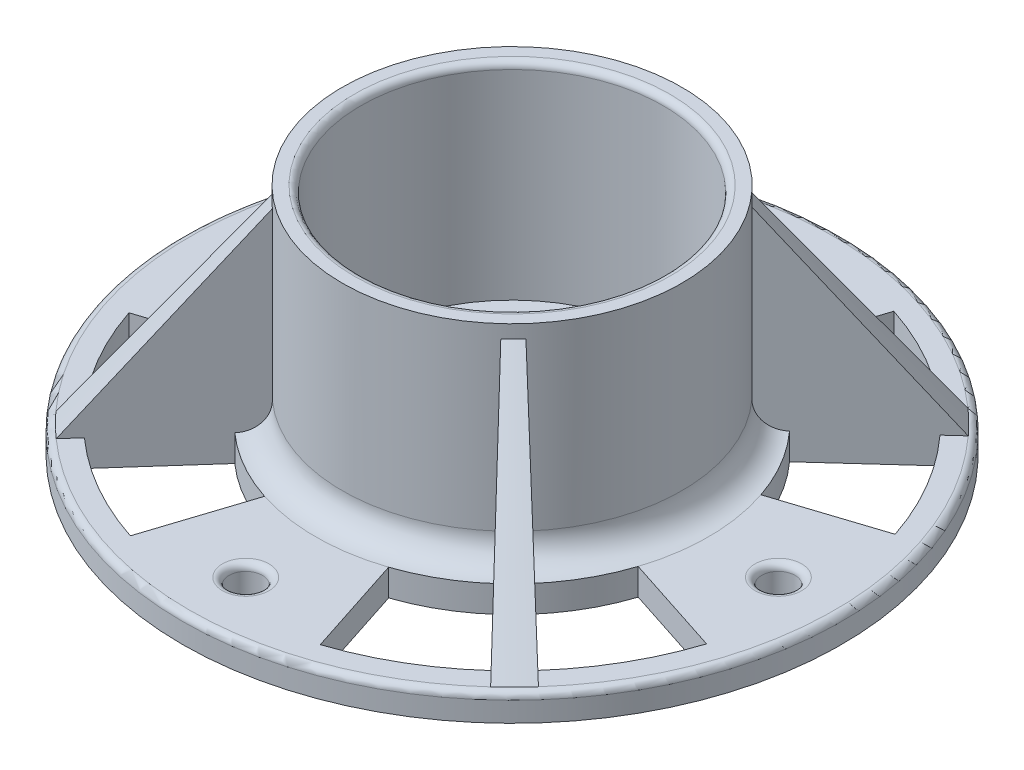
ISO-10303-21;
HEADER;
FILE_DESCRIPTION(('STEP AP214'),'2;1');
FILE_NAME('part.step','',(''),(''),'','','');
FILE_SCHEMA(('AUTOMOTIVE_DESIGN { 1 0 10303 214 1 1 1 1 }'));
ENDSEC;
DATA;
#1=APPLICATION_CONTEXT('core data for automotive mechanical design processes');
#2=APPLICATION_PROTOCOL_DEFINITION('international standard','automotive_design',2000,#1);
#3=PRODUCT_CONTEXT('',#1,'mechanical');
#4=PRODUCT('Part','Part','',(#3));
#5=PRODUCT_RELATED_PRODUCT_CATEGORY('part','',(#4));
#6=PRODUCT_DEFINITION_FORMATION('','',#4);
#7=PRODUCT_DEFINITION_CONTEXT('part definition',#1,'design');
#8=PRODUCT_DEFINITION('design','',#6,#7);
#9=PRODUCT_DEFINITION_SHAPE('','',#8);
#10=(LENGTH_UNIT() NAMED_UNIT(*) SI_UNIT(.MILLI.,.METRE.));
#11=(NAMED_UNIT(*) PLANE_ANGLE_UNIT() SI_UNIT($,.RADIAN.));
#12=(NAMED_UNIT(*) SI_UNIT($,.STERADIAN.) SOLID_ANGLE_UNIT());
#13=UNCERTAINTY_MEASURE_WITH_UNIT(LENGTH_MEASURE(1.E-05),#10,'distance_accuracy_value','');
#14=(GEOMETRIC_REPRESENTATION_CONTEXT(3) GLOBAL_UNCERTAINTY_ASSIGNED_CONTEXT((#13)) GLOBAL_UNIT_ASSIGNED_CONTEXT((#10,
#11,#12)) REPRESENTATION_CONTEXT('',''));
#15=CARTESIAN_POINT('',(0.,0.,0.));
#16=DIRECTION('',(0.,0.,1.));
#17=DIRECTION('',(1.,0.,0.));
#18=AXIS2_PLACEMENT_3D('',#15,#16,#17);
#19=CARTESIAN_POINT('',(0.,5.08,0.));
#20=DIRECTION('',(0.,1.,0.));
#21=DIRECTION('',(0.,0.,1.));
#22=AXIS2_PLACEMENT_3D('',#19,#20,#21);
#23=PLANE('',#22);
#24=CARTESIAN_POINT('',(50.8,5.08,1.77367252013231E-13));
#25=DIRECTION('',(0.,1.,0.));
#26=DIRECTION('',(0.,0.,1.));
#27=AXIS2_PLACEMENT_3D('',#24,#25,#26);
#28=CIRCLE('',#27,4.445);
#29=CARTESIAN_POINT('',(50.8,5.08,4.44500000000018));
#30=VERTEX_POINT('',#29);
#31=EDGE_CURVE('E680',#30,#30,#28,.F.);
#32=ORIENTED_EDGE('',*,*,#31,.T.);
#33=EDGE_LOOP('',(#32));
#34=FACE_BOUND('',#33,.T.);
#35=CARTESIAN_POINT('',(0.,5.08,0.));
#36=DIRECTION('',(0.,1.,0.));
#37=DIRECTION('',(-1.,0.,0.));
#38=AXIS2_PLACEMENT_3D('',#35,#36,#37);
#39=CIRCLE('',#38,57.785);
#40=CARTESIAN_POINT('',(43.1505795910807,5.08,38.4334971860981));
#41=VERTEX_POINT('',#40);
#42=CARTESIAN_POINT('',(54.9568007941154,5.08,17.8565470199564));
#43=VERTEX_POINT('',#42);
#44=EDGE_CURVE('E574',#41,#43,#39,.T.);
#45=ORIENTED_EDGE('',*,*,#44,.F.);
#46=DIRECTION('',(0.746743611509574,0.,0.665112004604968));
#47=VECTOR('',#46,1.);
#48=CARTESIAN_POINT('',(0.,5.08,0.));
#49=LINE('',#48,#47);
#50=CARTESIAN_POINT('',(45.9956727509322,5.08,40.967573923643));
#51=VERTEX_POINT('',#50);
#52=EDGE_CURVE('E340',#41,#51,#49,.T.);
#53=ORIENTED_EDGE('',*,*,#52,.T.);
#54=CARTESIAN_POINT('',(0.,5.08,0.));
#55=DIRECTION('',(0.,1.,0.));
#56=DIRECTION('',(0.,0.,1.));
#57=AXIS2_PLACEMENT_3D('',#54,#55,#56);
#58=CIRCLE('',#57,61.595);
#59=CARTESIAN_POINT('',(45.5510062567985,5.08,-41.4614260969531));
#60=VERTEX_POINT('',#59);
#61=EDGE_CURVE('E661',#51,#60,#58,.T.);
#62=ORIENTED_EDGE('',*,*,#61,.T.);
#63=DIRECTION('',(0.739524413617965,0.,-0.673129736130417));
#64=VECTOR('',#63,1.);
#65=CARTESIAN_POINT('',(0.,5.08,0.));
#66=LINE('',#65,#64);
#67=CARTESIAN_POINT('',(42.7334182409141,5.08,-38.8968018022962));
#68=VERTEX_POINT('',#67);
#69=EDGE_CURVE('E478',#68,#60,#66,.T.);
#70=ORIENTED_EDGE('',*,*,#69,.F.);
#71=CARTESIAN_POINT('',(0.,5.08,0.));
#72=DIRECTION('',(0.,1.,0.));
#73=DIRECTION('',(0.,0.,1.));
#74=AXIS2_PLACEMENT_3D('',#71,#72,#73);
#75=CIRCLE('',#74,57.785);
#76=CARTESIAN_POINT('',(54.8305512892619,5.08,-18.2405282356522));
#77=VERTEX_POINT('',#76);
#78=EDGE_CURVE('E611',#77,#68,#75,.T.);
#79=ORIENTED_EDGE('',*,*,#78,.F.);
#80=DIRECTION('',(0.951056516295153,0.,-0.309016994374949));
#81=VECTOR('',#80,1.);
#82=CARTESIAN_POINT('',(-0.124905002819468,5.08,-0.384418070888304));
#83=LINE('',#82,#81);
#84=CARTESIAN_POINT('',(35.5043536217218,5.08,-11.961065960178));
#85=VERTEX_POINT('',#84);
#86=EDGE_CURVE('E586',#85,#77,#83,.T.);
#87=ORIENTED_EDGE('',*,*,#86,.F.);
#88=CARTESIAN_POINT('',(0.,5.08,0.));
#89=DIRECTION('',(0.,1.,0.));
#90=DIRECTION('',(0.,0.,1.));
#91=AXIS2_PLACEMENT_3D('',#88,#89,#90);
#92=CIRCLE('',#91,37.465);
#93=CARTESIAN_POINT('',(35.6313323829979,5.08,11.5773216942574));
#94=VERTEX_POINT('',#93);
#95=EDGE_CURVE('E663',#85,#94,#92,.F.);
#96=ORIENTED_EDGE('',*,*,#95,.T.);
#97=DIRECTION('',(0.951056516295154,0.,0.309016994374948));
#98=VECTOR('',#97,1.);
#99=CARTESIAN_POINT('',(0.,5.08,0.));
#100=LINE('',#99,#98);
#101=EDGE_CURVE('E578',#94,#43,#100,.T.);
#102=ORIENTED_EDGE('',*,*,#101,.T.);
#103=EDGE_LOOP('',(#45,#53,#62,#70,#79,#87,#96,#102));
#104=FACE_BOUND('',#103,.T.);
#105=ADVANCED_FACE('F42',(#34,#104),#23,.T.);
#106=CARTESIAN_POINT('',(0.,10.16,0.));
#107=DIRECTION('',(0.,1.,0.));
#108=DIRECTION('',(0.,0.,1.));
#109=AXIS2_PLACEMENT_3D('',#106,#107,#108);
#110=TOROIDAL_SURFACE('',#109,37.465,5.08);
#111=CARTESIAN_POINT('',(27.9767494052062,10.16,24.9184212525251));
#112=DIRECTION('',(-0.665112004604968,0.,0.746743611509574));
#113=DIRECTION('',(0.746743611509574,0.,0.665112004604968));
#114=AXIS2_PLACEMENT_3D('',#111,#112,#113);
#115=CIRCLE('',#114,5.08);
#116=CARTESIAN_POINT('',(27.9767494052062,5.08,24.9184212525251));
#117=VERTEX_POINT('',#116);
#118=CARTESIAN_POINT('',(24.1832918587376,10.16,21.5396522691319));
#119=VERTEX_POINT('',#118);
#120=EDGE_CURVE('E367',#117,#119,#115,.F.);
#121=ORIENTED_EDGE('',*,*,#120,.F.);
#122=CARTESIAN_POINT('',(0.,5.08,0.));
#123=DIRECTION('',(0.,1.,0.));
#124=DIRECTION('',(-1.,0.,0.));
#125=AXIS2_PLACEMENT_3D('',#122,#123,#124);
#126=CIRCLE('',#125,37.465);
#127=EDGE_CURVE('E564',#94,#117,#126,.F.);
#128=ORIENTED_EDGE('',*,*,#127,.F.);
#129=ORIENTED_EDGE('',*,*,#95,.F.);
#130=CARTESIAN_POINT('',(27.706282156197,5.08,-25.2188055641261));
#131=VERTEX_POINT('',#130);
#132=EDGE_CURVE('E662',#131,#85,#92,.F.);
#133=ORIENTED_EDGE('',*,*,#132,.F.);
#134=CARTESIAN_POINT('',(27.706282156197,10.16,-25.2188055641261));
#135=DIRECTION('',(0.673129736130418,0.,0.739524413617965));
#136=DIRECTION('',(0.739524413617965,0.,-0.673129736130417));
#137=AXIS2_PLACEMENT_3D('',#134,#135,#136);
#138=CIRCLE('',#137,5.08);
#139=CARTESIAN_POINT('',(23.9494981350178,10.16,-21.7993065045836));
#140=VERTEX_POINT('',#139);
#141=EDGE_CURVE('E483',#131,#140,#138,.F.);
#142=ORIENTED_EDGE('',*,*,#141,.T.);
#143=CARTESIAN_POINT('',(0.,10.16,0.));
#144=DIRECTION('',(0.,1.,0.));
#145=DIRECTION('',(0.,0.,1.));
#146=AXIS2_PLACEMENT_3D('',#143,#144,#145);
#147=CIRCLE('',#146,32.385);
#148=EDGE_CURVE('E653',#119,#140,#147,.T.);
#149=ORIENTED_EDGE('',*,*,#148,.F.);
#150=EDGE_LOOP('',(#121,#128,#129,#133,#142,#149));
#151=FACE_BOUND('',#150,.T.);
#152=ADVANCED_FACE('F759',(#151),#110,.F.);
#153=CARTESIAN_POINT('',(0.,0.,0.));
#154=DIRECTION('',(0.,1.,0.));
#155=DIRECTION('',(0.,0.,1.));
#156=AXIS2_PLACEMENT_3D('',#153,#154,#155);
#157=CYLINDRICAL_SURFACE('',#156,37.465);
#158=DIRECTION('',(0.,1.,0.));
#159=VECTOR('',#158,1.);
#160=CARTESIAN_POINT('',(27.9767494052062,0.,24.9184212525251));
#161=LINE('',#160,#159);
#162=CARTESIAN_POINT('',(27.9767494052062,0.,24.9184212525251));
#163=VERTEX_POINT('',#162);
#164=EDGE_CURVE('E365',#163,#117,#161,.T.);
#165=ORIENTED_EDGE('',*,*,#164,.F.);
#166=CARTESIAN_POINT('',(0.,0.,0.));
#167=DIRECTION('',(0.,1.,0.));
#168=DIRECTION('',(-1.,0.,0.));
#169=AXIS2_PLACEMENT_3D('',#166,#167,#168);
#170=CIRCLE('',#169,37.465);
#171=CARTESIAN_POINT('',(35.6313323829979,0.,11.5773216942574));
#172=VERTEX_POINT('',#171);
#173=EDGE_CURVE('E346',#172,#163,#170,.F.);
#174=ORIENTED_EDGE('',*,*,#173,.F.);
#175=DIRECTION('',(0.,1.,0.));
#176=VECTOR('',#175,1.);
#177=CARTESIAN_POINT('',(35.6313323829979,0.,11.5773216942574));
#178=LINE('',#177,#176);
#179=EDGE_CURVE('E587',#172,#94,#178,.T.);
#180=ORIENTED_EDGE('',*,*,#179,.T.);
#181=ORIENTED_EDGE('',*,*,#127,.T.);
#182=EDGE_LOOP('',(#165,#174,#180,#181));
#183=FACE_BOUND('',#182,.T.);
#184=ADVANCED_FACE('F763',(#183),#157,.T.);
#185=CARTESIAN_POINT('',(0.,0.,0.));
#186=DIRECTION('',(0.,1.,0.));
#187=DIRECTION('',(0.,0.,1.));
#188=AXIS2_PLACEMENT_3D('',#185,#186,#187);
#189=CYLINDRICAL_SURFACE('',#188,57.785);
#190=DIRECTION('',(0.,1.,0.));
#191=VECTOR('',#190,1.);
#192=CARTESIAN_POINT('',(43.1505795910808,0.,38.4334971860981));
#193=LINE('',#192,#191);
#194=CARTESIAN_POINT('',(43.1505795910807,0.,38.4334971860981));
#195=VERTEX_POINT('',#194);
#196=EDGE_CURVE('E50',#41,#195,#193,.F.);
#197=ORIENTED_EDGE('',*,*,#196,.F.);
#198=ORIENTED_EDGE('',*,*,#44,.T.);
#199=DIRECTION('',(0.,1.,0.));
#200=VECTOR('',#199,1.);
#201=CARTESIAN_POINT('',(54.9568007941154,0.,17.8565470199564));
#202=LINE('',#201,#200);
#203=CARTESIAN_POINT('',(54.9568007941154,0.,17.8565470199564));
#204=VERTEX_POINT('',#203);
#205=EDGE_CURVE('E325',#204,#43,#202,.T.);
#206=ORIENTED_EDGE('',*,*,#205,.F.);
#207=CARTESIAN_POINT('',(0.,0.,0.));
#208=DIRECTION('',(0.,1.,0.));
#209=DIRECTION('',(-1.,0.,0.));
#210=AXIS2_PLACEMENT_3D('',#207,#208,#209);
#211=CIRCLE('',#210,57.785);
#212=EDGE_CURVE('E320',#195,#204,#211,.T.);
#213=ORIENTED_EDGE('',*,*,#212,.F.);
#214=EDGE_LOOP('',(#197,#198,#206,#213));
#215=FACE_BOUND('',#214,.T.);
#216=ADVANCED_FACE('F322',(#215),#189,.F.);
#217=DIRECTION('',(0.673129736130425,0.,0.739524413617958));
#218=VECTOR('',#217,1.);
#219=CARTESIAN_POINT('',(0.,5.08,0.));
#220=LINE('',#219,#218);
#221=CARTESIAN_POINT('',(38.8968018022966,5.08,42.7334182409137));
#222=VERTEX_POINT('',#221);
#223=CARTESIAN_POINT('',(41.4614260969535,5.08,45.5510062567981));
#224=VERTEX_POINT('',#223);
#225=EDGE_CURVE('E370',#222,#224,#220,.T.);
#226=ORIENTED_EDGE('',*,*,#225,.F.);
#227=CARTESIAN_POINT('',(18.240528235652,5.08,54.8305512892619));
#228=VERTEX_POINT('',#227);
#229=EDGE_CURVE('E575',#228,#222,#39,.T.);
#230=ORIENTED_EDGE('',*,*,#229,.F.);
#231=DIRECTION('',(0.309016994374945,0.,0.951056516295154));
#232=VECTOR('',#231,1.);
#233=CARTESIAN_POINT('',(0.384418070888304,5.08,-0.124905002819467));
#234=LINE('',#233,#232);
#235=CARTESIAN_POINT('',(11.9610659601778,5.08,35.5043536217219));
#236=VERTEX_POINT('',#235);
#237=EDGE_CURVE('E555',#236,#228,#234,.T.);
#238=ORIENTED_EDGE('',*,*,#237,.F.);
#239=CARTESIAN_POINT('',(-11.5773216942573,5.08,35.631332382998));
#240=VERTEX_POINT('',#239);
#241=EDGE_CURVE('E742',#236,#240,#92,.F.);
#242=ORIENTED_EDGE('',*,*,#241,.T.);
#243=DIRECTION('',(-0.309016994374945,0.,0.951056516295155));
#244=VECTOR('',#243,1.);
#245=CARTESIAN_POINT('',(0.,5.08,0.));
#246=LINE('',#245,#244);
#247=CARTESIAN_POINT('',(-17.8565470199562,5.08,54.9568007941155));
#248=VERTEX_POINT('',#247);
#249=EDGE_CURVE('E547',#240,#248,#246,.T.);
#250=ORIENTED_EDGE('',*,*,#249,.T.);
#251=CARTESIAN_POINT('',(0.,5.08,0.));
#252=DIRECTION('',(0.,1.,0.));
#253=DIRECTION('',(0.,0.,-1.));
#254=AXIS2_PLACEMENT_3D('',#251,#252,#253);
#255=CIRCLE('',#254,57.785);
#256=CARTESIAN_POINT('',(-38.4334971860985,5.08,43.1505795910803));
#257=VERTEX_POINT('',#256);
#258=EDGE_CURVE('E543',#257,#248,#255,.T.);
#259=ORIENTED_EDGE('',*,*,#258,.F.);
#260=DIRECTION('',(-0.665112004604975,0.,0.746743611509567));
#261=VECTOR('',#260,1.);
#262=CARTESIAN_POINT('',(0.,5.08,0.));
#263=LINE('',#262,#261);
#264=CARTESIAN_POINT('',(-40.9675739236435,5.08,45.9956727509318));
#265=VERTEX_POINT('',#264);
#266=EDGE_CURVE('E399',#257,#265,#263,.T.);
#267=ORIENTED_EDGE('',*,*,#266,.T.);
#268=EDGE_CURVE('E1437',#265,#224,#58,.T.);
#269=ORIENTED_EDGE('',*,*,#268,.T.);
#270=EDGE_LOOP('',(#226,#230,#238,#242,#250,#259,#267,#269));
#271=FACE_BOUND('',#270,.T.);
#272=CARTESIAN_POINT('',(0.,5.08,50.8));
#273=DIRECTION('',(0.,1.,0.));
#274=DIRECTION('',(0.,0.,1.));
#275=AXIS2_PLACEMENT_3D('',#272,#273,#274);
#276=CIRCLE('',#275,4.445);
#277=CARTESIAN_POINT('',(0.,5.08,55.245));
#278=VERTEX_POINT('',#277);
#279=EDGE_CURVE('E686',#278,#278,#276,.F.);
#280=ORIENTED_EDGE('',*,*,#279,.T.);
#281=EDGE_LOOP('',(#280));
#282=FACE_BOUND('',#281,.T.);
#283=ADVANCED_FACE('F783',(#271,#282),#23,.T.);
#284=CARTESIAN_POINT('',(25.2188055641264,5.08,27.7062821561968));
#285=VERTEX_POINT('',#284);
#286=EDGE_CURVE('E581',#285,#236,#126,.F.);
#287=ORIENTED_EDGE('',*,*,#286,.F.);
#288=CARTESIAN_POINT('',(25.2188055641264,10.16,27.7062821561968));
#289=DIRECTION('',(-0.739524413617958,0.,0.673129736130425));
#290=DIRECTION('',(0.673129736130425,0.,0.739524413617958));
#291=AXIS2_PLACEMENT_3D('',#288,#289,#290);
#292=CIRCLE('',#291,5.08);
#293=CARTESIAN_POINT('',(21.7993065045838,10.16,23.9494981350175));
#294=VERTEX_POINT('',#293);
#295=EDGE_CURVE('E375',#285,#294,#292,.F.);
#296=ORIENTED_EDGE('',*,*,#295,.T.);
#297=CARTESIAN_POINT('',(-21.5396522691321,10.16,24.1832918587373));
#298=VERTEX_POINT('',#297);
#299=EDGE_CURVE('E878',#298,#294,#147,.T.);
#300=ORIENTED_EDGE('',*,*,#299,.F.);
#301=CARTESIAN_POINT('',(-24.9184212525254,10.16,27.9767494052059));
#302=DIRECTION('',(-0.746743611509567,0.,-0.665112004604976));
#303=DIRECTION('',(-0.665112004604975,0.,0.746743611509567));
#304=AXIS2_PLACEMENT_3D('',#301,#302,#303);
#305=CIRCLE('',#304,5.08);
#306=CARTESIAN_POINT('',(-24.9184212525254,5.08,27.9767494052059));
#307=VERTEX_POINT('',#306);
#308=EDGE_CURVE('E404',#307,#298,#305,.F.);
#309=ORIENTED_EDGE('',*,*,#308,.F.);
#310=CARTESIAN_POINT('',(0.,5.08,0.));
#311=DIRECTION('',(0.,1.,0.));
#312=DIRECTION('',(0.,0.,-1.));
#313=AXIS2_PLACEMENT_3D('',#310,#311,#312);
#314=CIRCLE('',#313,37.465);
#315=EDGE_CURVE('E529',#240,#307,#314,.F.);
#316=ORIENTED_EDGE('',*,*,#315,.F.);
#317=ORIENTED_EDGE('',*,*,#241,.F.);
#318=EDGE_LOOP('',(#287,#296,#300,#309,#316,#317));
#319=FACE_BOUND('',#318,.T.);
#320=ADVANCED_FACE('F789',(#319),#110,.F.);
#321=CARTESIAN_POINT('',(0.,0.,0.));
#322=DIRECTION('',(0.,1.,0.));
#323=DIRECTION('',(0.,0.,1.));
#324=AXIS2_PLACEMENT_3D('',#321,#322,#323);
#325=CYLINDRICAL_SURFACE('',#324,37.465);
#326=DIRECTION('',(0.,1.,0.));
#327=VECTOR('',#326,1.);
#328=CARTESIAN_POINT('',(-24.9184212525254,0.,27.9767494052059));
#329=LINE('',#328,#327);
#330=CARTESIAN_POINT('',(-24.9184212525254,0.,27.9767494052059));
#331=VERTEX_POINT('',#330);
#332=EDGE_CURVE('E401',#331,#307,#329,.T.);
#333=ORIENTED_EDGE('',*,*,#332,.F.);
#334=CARTESIAN_POINT('',(0.,0.,0.));
#335=DIRECTION('',(0.,1.,0.));
#336=DIRECTION('',(0.,0.,-1.));
#337=AXIS2_PLACEMENT_3D('',#334,#335,#336);
#338=CIRCLE('',#337,37.465);
#339=CARTESIAN_POINT('',(-11.5773216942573,0.,35.631332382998));
#340=VERTEX_POINT('',#339);
#341=EDGE_CURVE('E537',#340,#331,#338,.F.);
#342=ORIENTED_EDGE('',*,*,#341,.F.);
#343=DIRECTION('',(0.,1.,0.));
#344=VECTOR('',#343,1.);
#345=CARTESIAN_POINT('',(-11.5773216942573,0.,35.631332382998));
#346=LINE('',#345,#344);
#347=EDGE_CURVE('E556',#340,#240,#346,.T.);
#348=ORIENTED_EDGE('',*,*,#347,.T.);
#349=ORIENTED_EDGE('',*,*,#315,.T.);
#350=EDGE_LOOP('',(#333,#342,#348,#349));
#351=FACE_BOUND('',#350,.T.);
#352=ADVANCED_FACE('F815',(#351),#325,.T.);
#353=CARTESIAN_POINT('',(0.,0.,0.));
#354=DIRECTION('',(0.,1.,0.));
#355=DIRECTION('',(0.,0.,1.));
#356=AXIS2_PLACEMENT_3D('',#353,#354,#355);
#357=CYLINDRICAL_SURFACE('',#356,57.785);
#358=DIRECTION('',(0.,1.,0.));
#359=VECTOR('',#358,1.);
#360=CARTESIAN_POINT('',(-38.4334971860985,0.,43.1505795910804));
#361=LINE('',#360,#359);
#362=CARTESIAN_POINT('',(-38.4334971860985,0.,43.1505795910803));
#363=VERTEX_POINT('',#362);
#364=EDGE_CURVE('E711',#257,#363,#361,.F.);
#365=ORIENTED_EDGE('',*,*,#364,.F.);
#366=ORIENTED_EDGE('',*,*,#258,.T.);
#367=DIRECTION('',(0.,1.,0.));
#368=VECTOR('',#367,1.);
#369=CARTESIAN_POINT('',(-17.8565470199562,0.,54.9568007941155));
#370=LINE('',#369,#368);
#371=CARTESIAN_POINT('',(-17.8565470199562,0.,54.9568007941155));
#372=VERTEX_POINT('',#371);
#373=EDGE_CURVE('E559',#372,#248,#370,.T.);
#374=ORIENTED_EDGE('',*,*,#373,.F.);
#375=CARTESIAN_POINT('',(0.,0.,0.));
#376=DIRECTION('',(0.,1.,0.));
#377=DIRECTION('',(0.,0.,-1.));
#378=AXIS2_PLACEMENT_3D('',#375,#376,#377);
#379=CIRCLE('',#378,57.785);
#380=EDGE_CURVE('E528',#363,#372,#379,.T.);
#381=ORIENTED_EDGE('',*,*,#380,.F.);
#382=EDGE_LOOP('',(#365,#366,#374,#381));
#383=FACE_BOUND('',#382,.T.);
#384=ADVANCED_FACE('F809',(#383),#357,.F.);
#385=DIRECTION('',(-0.739524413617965,0.,0.673129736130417));
#386=VECTOR('',#385,1.);
#387=CARTESIAN_POINT('',(0.,5.08,0.));
#388=LINE('',#387,#386);
#389=CARTESIAN_POINT('',(-42.7334182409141,5.08,38.8968018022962));
#390=VERTEX_POINT('',#389);
#391=CARTESIAN_POINT('',(-45.5510062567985,5.08,41.4614260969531));
#392=VERTEX_POINT('',#391);
#393=EDGE_CURVE('E407',#390,#392,#388,.T.);
#394=ORIENTED_EDGE('',*,*,#393,.F.);
#395=CARTESIAN_POINT('',(-54.8305512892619,5.08,18.2405282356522));
#396=VERTEX_POINT('',#395);
#397=EDGE_CURVE('E544',#396,#390,#255,.T.);
#398=ORIENTED_EDGE('',*,*,#397,.F.);
#399=DIRECTION('',(-0.951056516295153,0.,0.309016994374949));
#400=VECTOR('',#399,1.);
#401=CARTESIAN_POINT('',(0.124905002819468,5.08,0.384418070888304));
#402=LINE('',#401,#400);
#403=CARTESIAN_POINT('',(-35.5043536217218,5.08,11.961065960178));
#404=VERTEX_POINT('',#403);
#405=EDGE_CURVE('E517',#404,#396,#402,.T.);
#406=ORIENTED_EDGE('',*,*,#405,.F.);
#407=CARTESIAN_POINT('',(-35.6313323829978,5.08,-11.5773216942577));
#408=VERTEX_POINT('',#407);
#409=EDGE_CURVE('E738',#404,#408,#92,.F.);
#410=ORIENTED_EDGE('',*,*,#409,.T.);
#411=DIRECTION('',(-0.951056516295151,0.,-0.309016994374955));
#412=VECTOR('',#411,1.);
#413=CARTESIAN_POINT('',(0.,5.08,0.));
#414=LINE('',#413,#412);
#415=CARTESIAN_POINT('',(-54.9568007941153,5.08,-17.8565470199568));
#416=VERTEX_POINT('',#415);
#417=EDGE_CURVE('E509',#408,#416,#414,.T.);
#418=ORIENTED_EDGE('',*,*,#417,.T.);
#419=CARTESIAN_POINT('',(0.,5.08,0.));
#420=DIRECTION('',(0.,1.,0.));
#421=DIRECTION('',(1.,0.,0.));
#422=AXIS2_PLACEMENT_3D('',#419,#420,#421);
#423=CIRCLE('',#422,57.785);
#424=CARTESIAN_POINT('',(-43.1505795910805,5.08,-38.4334971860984));
#425=VERTEX_POINT('',#424);
#426=EDGE_CURVE('E505',#425,#416,#423,.T.);
#427=ORIENTED_EDGE('',*,*,#426,.F.);
#428=DIRECTION('',(-0.746743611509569,0.,-0.665112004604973));
#429=VECTOR('',#428,1.);
#430=CARTESIAN_POINT('',(0.,5.08,0.));
#431=LINE('',#430,#429);
#432=CARTESIAN_POINT('',(-45.9956727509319,5.08,-40.9675739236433));
#433=VERTEX_POINT('',#432);
#434=EDGE_CURVE('E436',#425,#433,#431,.T.);
#435=ORIENTED_EDGE('',*,*,#434,.T.);
#436=EDGE_CURVE('E1441',#433,#392,#58,.T.);
#437=ORIENTED_EDGE('',*,*,#436,.T.);
#438=EDGE_LOOP('',(#394,#398,#406,#410,#418,#427,#435,#437));
#439=FACE_BOUND('',#438,.T.);
#440=CARTESIAN_POINT('',(-50.8,5.08,-5.32101756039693E-13));
#441=DIRECTION('',(0.,1.,0.));
#442=DIRECTION('',(0.,0.,1.));
#443=AXIS2_PLACEMENT_3D('',#440,#441,#442);
#444=CIRCLE('',#443,4.445);
#445=CARTESIAN_POINT('',(-50.8,5.08,4.44499999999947));
#446=VERTEX_POINT('',#445);
#447=EDGE_CURVE('E692',#446,#446,#444,.F.);
#448=ORIENTED_EDGE('',*,*,#447,.T.);
#449=EDGE_LOOP('',(#448));
#450=FACE_BOUND('',#449,.T.);
#451=ADVANCED_FACE('F795',(#439,#450),#23,.T.);
#452=CARTESIAN_POINT('',(-27.706282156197,5.08,25.2188055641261));
#453=VERTEX_POINT('',#452);
#454=EDGE_CURVE('E550',#453,#404,#314,.F.);
#455=ORIENTED_EDGE('',*,*,#454,.F.);
#456=CARTESIAN_POINT('',(-27.706282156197,10.16,25.2188055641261));
#457=DIRECTION('',(-0.673129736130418,0.,-0.739524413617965));
#458=DIRECTION('',(-0.739524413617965,0.,0.673129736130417));
#459=AXIS2_PLACEMENT_3D('',#456,#457,#458);
#460=CIRCLE('',#459,5.08);
#461=CARTESIAN_POINT('',(-23.9494981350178,10.16,21.7993065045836));
#462=VERTEX_POINT('',#461);
#463=EDGE_CURVE('E412',#453,#462,#460,.F.);
#464=ORIENTED_EDGE('',*,*,#463,.T.);
#465=CARTESIAN_POINT('',(-24.1832918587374,10.16,-21.539652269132));
#466=VERTEX_POINT('',#465);
#467=EDGE_CURVE('E658',#466,#462,#147,.T.);
#468=ORIENTED_EDGE('',*,*,#467,.F.);
#469=CARTESIAN_POINT('',(-27.976749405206,10.16,-24.9184212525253));
#470=DIRECTION('',(0.665112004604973,0.,-0.746743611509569));
#471=DIRECTION('',(-0.746743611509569,0.,-0.665112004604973));
#472=AXIS2_PLACEMENT_3D('',#469,#470,#471);
#473=CIRCLE('',#472,5.08);
#474=CARTESIAN_POINT('',(-27.976749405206,5.08,-24.9184212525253));
#475=VERTEX_POINT('',#474);
#476=EDGE_CURVE('E441',#475,#466,#473,.F.);
#477=ORIENTED_EDGE('',*,*,#476,.F.);
#478=CARTESIAN_POINT('',(0.,5.08,0.));
#479=DIRECTION('',(0.,1.,0.));
#480=DIRECTION('',(1.,0.,0.));
#481=AXIS2_PLACEMENT_3D('',#478,#479,#480);
#482=CIRCLE('',#481,37.465);
#483=EDGE_CURVE('E491',#408,#475,#482,.F.);
#484=ORIENTED_EDGE('',*,*,#483,.F.);
#485=ORIENTED_EDGE('',*,*,#409,.F.);
#486=EDGE_LOOP('',(#455,#464,#468,#477,#484,#485));
#487=FACE_BOUND('',#486,.T.);
#488=ADVANCED_FACE('F733',(#487),#110,.F.);
#489=CARTESIAN_POINT('',(0.,0.,0.));
#490=DIRECTION('',(0.,1.,0.));
#491=DIRECTION('',(0.,0.,1.));
#492=AXIS2_PLACEMENT_3D('',#489,#490,#491);
#493=CYLINDRICAL_SURFACE('',#492,37.465);
#494=DIRECTION('',(0.,1.,0.));
#495=VECTOR('',#494,1.);
#496=CARTESIAN_POINT('',(-27.976749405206,0.,-24.9184212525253));
#497=LINE('',#496,#495);
#498=CARTESIAN_POINT('',(-27.976749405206,0.,-24.9184212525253));
#499=VERTEX_POINT('',#498);
#500=EDGE_CURVE('E438',#499,#475,#497,.T.);
#501=ORIENTED_EDGE('',*,*,#500,.F.);
#502=CARTESIAN_POINT('',(0.,0.,0.));
#503=DIRECTION('',(0.,1.,0.));
#504=DIRECTION('',(1.,0.,0.));
#505=AXIS2_PLACEMENT_3D('',#502,#503,#504);
#506=CIRCLE('',#505,37.465);
#507=CARTESIAN_POINT('',(-35.6313323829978,0.,-11.5773216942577));
#508=VERTEX_POINT('',#507);
#509=EDGE_CURVE('E499',#508,#499,#506,.F.);
#510=ORIENTED_EDGE('',*,*,#509,.F.);
#511=DIRECTION('',(0.,1.,0.));
#512=VECTOR('',#511,1.);
#513=CARTESIAN_POINT('',(-35.6313323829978,0.,-11.5773216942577));
#514=LINE('',#513,#512);
#515=EDGE_CURVE('E518',#508,#408,#514,.T.);
#516=ORIENTED_EDGE('',*,*,#515,.T.);
#517=ORIENTED_EDGE('',*,*,#483,.T.);
#518=EDGE_LOOP('',(#501,#510,#516,#517));
#519=FACE_BOUND('',#518,.T.);
#520=ADVANCED_FACE('F814',(#519),#493,.T.);
#521=CARTESIAN_POINT('',(0.,0.,0.));
#522=DIRECTION('',(0.,1.,0.));
#523=DIRECTION('',(0.,0.,1.));
#524=AXIS2_PLACEMENT_3D('',#521,#522,#523);
#525=CYLINDRICAL_SURFACE('',#524,57.785);
#526=DIRECTION('',(0.,1.,0.));
#527=VECTOR('',#526,1.);
#528=CARTESIAN_POINT('',(-43.1505795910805,0.,-38.4334971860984));
#529=LINE('',#528,#527);
#530=CARTESIAN_POINT('',(-43.1505795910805,0.,-38.4334971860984));
#531=VERTEX_POINT('',#530);
#532=EDGE_CURVE('E706',#425,#531,#529,.F.);
#533=ORIENTED_EDGE('',*,*,#532,.F.);
#534=ORIENTED_EDGE('',*,*,#426,.T.);
#535=DIRECTION('',(0.,1.,0.));
#536=VECTOR('',#535,1.);
#537=CARTESIAN_POINT('',(-54.9568007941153,0.,-17.8565470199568));
#538=LINE('',#537,#536);
#539=CARTESIAN_POINT('',(-54.9568007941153,0.,-17.8565470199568));
#540=VERTEX_POINT('',#539);
#541=EDGE_CURVE('E521',#540,#416,#538,.T.);
#542=ORIENTED_EDGE('',*,*,#541,.F.);
#543=CARTESIAN_POINT('',(0.,0.,0.));
#544=DIRECTION('',(0.,1.,0.));
#545=DIRECTION('',(1.,0.,0.));
#546=AXIS2_PLACEMENT_3D('',#543,#544,#545);
#547=CIRCLE('',#546,57.785);
#548=EDGE_CURVE('E490',#531,#540,#547,.T.);
#549=ORIENTED_EDGE('',*,*,#548,.F.);
#550=EDGE_LOOP('',(#533,#534,#542,#549));
#551=FACE_BOUND('',#550,.T.);
#552=ADVANCED_FACE('F936',(#551),#525,.F.);
#553=CARTESIAN_POINT('',(0.,0.,0.));
#554=DIRECTION('',(0.,1.,0.));
#555=DIRECTION('',(0.,0.,1.));
#556=AXIS2_PLACEMENT_3D('',#553,#554,#555);
#557=CYLINDRICAL_SURFACE('',#556,37.465);
#558=DIRECTION('',(0.,1.,0.));
#559=VECTOR('',#558,1.);
#560=CARTESIAN_POINT('',(24.9184212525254,0.,-27.9767494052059));
#561=LINE('',#560,#559);
#562=CARTESIAN_POINT('',(24.9184212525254,0.,-27.9767494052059));
#563=VERTEX_POINT('',#562);
#564=CARTESIAN_POINT('',(24.9184212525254,5.08,-27.9767494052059));
#565=VERTEX_POINT('',#564);
#566=EDGE_CURVE('E472',#563,#565,#561,.T.);
#567=ORIENTED_EDGE('',*,*,#566,.F.);
#568=CARTESIAN_POINT('',(0.,0.,0.));
#569=DIRECTION('',(0.,1.,0.));
#570=DIRECTION('',(0.,0.,1.));
#571=AXIS2_PLACEMENT_3D('',#568,#569,#570);
#572=CIRCLE('',#571,37.465);
#573=CARTESIAN_POINT('',(11.5773216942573,0.,-35.631332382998));
#574=VERTEX_POINT('',#573);
#575=EDGE_CURVE('E604',#574,#563,#572,.F.);
#576=ORIENTED_EDGE('',*,*,#575,.F.);
#577=DIRECTION('',(0.,1.,0.));
#578=VECTOR('',#577,1.);
#579=CARTESIAN_POINT('',(11.5773216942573,0.,-35.631332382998));
#580=LINE('',#579,#578);
#581=CARTESIAN_POINT('',(11.5773216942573,5.08,-35.631332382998));
#582=VERTEX_POINT('',#581);
#583=EDGE_CURVE('E620',#574,#582,#580,.T.);
#584=ORIENTED_EDGE('',*,*,#583,.T.);
#585=EDGE_CURVE('E659',#582,#565,#92,.F.);
#586=ORIENTED_EDGE('',*,*,#585,.T.);
#587=EDGE_LOOP('',(#567,#576,#584,#586));
#588=FACE_BOUND('',#587,.T.);
#589=ADVANCED_FACE('F938',(#588),#557,.T.);
#590=CARTESIAN_POINT('',(0.,0.,0.));
#591=DIRECTION('',(0.,1.,0.));
#592=DIRECTION('',(0.,0.,1.));
#593=AXIS2_PLACEMENT_3D('',#590,#591,#592);
#594=CYLINDRICAL_SURFACE('',#593,57.785);
#595=DIRECTION('',(0.,1.,0.));
#596=VECTOR('',#595,1.);
#597=CARTESIAN_POINT('',(38.4334971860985,0.,-43.1505795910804));
#598=LINE('',#597,#596);
#599=CARTESIAN_POINT('',(38.4334971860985,5.08,-43.1505795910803));
#600=VERTEX_POINT('',#599);
#601=CARTESIAN_POINT('',(38.4334971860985,0.,-43.1505795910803));
#602=VERTEX_POINT('',#601);
#603=EDGE_CURVE('E701',#600,#602,#598,.F.);
#604=ORIENTED_EDGE('',*,*,#603,.F.);
#605=CARTESIAN_POINT('',(17.8565470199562,5.08,-54.9568007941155));
#606=VERTEX_POINT('',#605);
#607=EDGE_CURVE('E610',#600,#606,#75,.T.);
#608=ORIENTED_EDGE('',*,*,#607,.T.);
#609=DIRECTION('',(0.,1.,0.));
#610=VECTOR('',#609,1.);
#611=CARTESIAN_POINT('',(17.8565470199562,0.,-54.9568007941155));
#612=LINE('',#611,#610);
#613=CARTESIAN_POINT('',(17.8565470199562,0.,-54.9568007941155));
#614=VERTEX_POINT('',#613);
#615=EDGE_CURVE('E623',#614,#606,#612,.T.);
#616=ORIENTED_EDGE('',*,*,#615,.F.);
#617=CARTESIAN_POINT('',(0.,0.,0.));
#618=DIRECTION('',(0.,1.,0.));
#619=DIRECTION('',(0.,0.,1.));
#620=AXIS2_PLACEMENT_3D('',#617,#618,#619);
#621=CIRCLE('',#620,57.785);
#622=EDGE_CURVE('E595',#602,#614,#621,.T.);
#623=ORIENTED_EDGE('',*,*,#622,.F.);
#624=EDGE_LOOP('',(#604,#608,#616,#623));
#625=FACE_BOUND('',#624,.T.);
#626=ADVANCED_FACE('F804',(#625),#594,.F.);
#627=CARTESIAN_POINT('',(0.,5.08,0.));
#628=DIRECTION('',(0.,-1.,0.));
#629=DIRECTION('',(0.,0.,-1.));
#630=AXIS2_PLACEMENT_3D('',#627,#628,#629);
#631=CYLINDRICAL_SURFACE('',#630,62.865);
#632=CARTESIAN_POINT('',(0.,3.81,0.));
#633=DIRECTION('',(0.,1.,0.));
#634=DIRECTION('',(0.,0.,1.));
#635=AXIS2_PLACEMENT_3D('',#632,#633,#634);
#636=CIRCLE('',#635,62.865);
#637=CARTESIAN_POINT('',(0.,3.81,62.865));
#638=VERTEX_POINT('',#637);
#639=EDGE_CURVE('E667',#638,#638,#636,.F.);
#640=ORIENTED_EDGE('',*,*,#639,.T.);
#641=EDGE_LOOP('',(#640));
#642=FACE_BOUND('',#641,.T.);
#643=CARTESIAN_POINT('',(0.,0.,0.));
#644=DIRECTION('',(0.,1.,0.));
#645=DIRECTION('',(0.,0.,1.));
#646=AXIS2_PLACEMENT_3D('',#643,#644,#645);
#647=CIRCLE('',#646,62.865);
#648=CARTESIAN_POINT('',(0.,0.,62.865));
#649=VERTEX_POINT('',#648);
#650=EDGE_CURVE('E650',#649,#649,#647,.T.);
#651=ORIENTED_EDGE('',*,*,#650,.T.);
#652=EDGE_LOOP('',(#651));
#653=FACE_BOUND('',#652,.T.);
#654=ADVANCED_FACE('F797',(#642,#653),#631,.T.);
#655=DIRECTION('',(-0.67312973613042,0.,-0.739524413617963));
#656=VECTOR('',#655,1.);
#657=CARTESIAN_POINT('',(0.,5.08,0.));
#658=LINE('',#657,#656);
#659=CARTESIAN_POINT('',(-38.8968018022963,5.08,-42.733418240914));
#660=VERTEX_POINT('',#659);
#661=CARTESIAN_POINT('',(-41.4614260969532,5.08,-45.5510062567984));
#662=VERTEX_POINT('',#661);
#663=EDGE_CURVE('E444',#660,#662,#658,.T.);
#664=ORIENTED_EDGE('',*,*,#663,.F.);
#665=CARTESIAN_POINT('',(-18.2405282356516,5.08,-54.830551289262));
#666=VERTEX_POINT('',#665);
#667=EDGE_CURVE('E506',#666,#660,#423,.T.);
#668=ORIENTED_EDGE('',*,*,#667,.F.);
#669=DIRECTION('',(-0.309016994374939,0.,-0.951056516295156));
#670=VECTOR('',#669,1.);
#671=CARTESIAN_POINT('',(-0.384418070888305,5.08,0.124905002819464));
#672=LINE('',#671,#670);
#673=CARTESIAN_POINT('',(-11.9610659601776,5.08,-35.5043536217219));
#674=VERTEX_POINT('',#673);
#675=EDGE_CURVE('E486',#674,#666,#672,.T.);
#676=ORIENTED_EDGE('',*,*,#675,.F.);
#677=EDGE_CURVE('E657',#674,#582,#92,.F.);
#678=ORIENTED_EDGE('',*,*,#677,.T.);
#679=DIRECTION('',(0.309016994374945,0.,-0.951056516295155));
#680=VECTOR('',#679,1.);
#681=CARTESIAN_POINT('',(0.,5.08,0.));
#682=LINE('',#681,#680);
#683=EDGE_CURVE('E596',#582,#606,#682,.T.);
#684=ORIENTED_EDGE('',*,*,#683,.T.);
#685=ORIENTED_EDGE('',*,*,#607,.F.);
#686=DIRECTION('',(0.665112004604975,0.,-0.746743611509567));
#687=VECTOR('',#686,1.);
#688=CARTESIAN_POINT('',(0.,5.08,0.));
#689=LINE('',#688,#687);
#690=CARTESIAN_POINT('',(40.9675739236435,5.08,-45.9956727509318));
#691=VERTEX_POINT('',#690);
#692=EDGE_CURVE('E470',#600,#691,#689,.T.);
#693=ORIENTED_EDGE('',*,*,#692,.T.);
#694=EDGE_CURVE('E668',#691,#662,#58,.T.);
#695=ORIENTED_EDGE('',*,*,#694,.T.);
#696=EDGE_LOOP('',(#664,#668,#676,#678,#684,#685,#693,#695));
#697=FACE_BOUND('',#696,.T.);
#698=CARTESIAN_POINT('',(0.,5.08,-50.8));
#699=DIRECTION('',(0.,1.,0.));
#700=DIRECTION('',(0.,0.,1.));
#701=AXIS2_PLACEMENT_3D('',#698,#699,#700);
#702=CIRCLE('',#701,4.445);
#703=CARTESIAN_POINT('',(0.,5.08,-46.355));
#704=VERTEX_POINT('',#703);
#705=EDGE_CURVE('E674',#704,#704,#702,.F.);
#706=ORIENTED_EDGE('',*,*,#705,.T.);
#707=EDGE_LOOP('',(#706));
#708=FACE_BOUND('',#707,.T.);
#709=ADVANCED_FACE('F784',(#697,#708),#23,.T.);
#710=CARTESIAN_POINT('',(0.,0.,0.));
#711=DIRECTION('',(0.,1.,0.));
#712=DIRECTION('',(0.,0.,1.));
#713=AXIS2_PLACEMENT_3D('',#710,#711,#712);
#714=PLANE('',#713);
#715=DIRECTION('',(-0.673129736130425,0.,-0.739524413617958));
#716=VECTOR('',#715,1.);
#717=CARTESIAN_POINT('',(42.3163008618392,0.,46.4902022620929));
#718=LINE('',#717,#716);
#719=CARTESIAN_POINT('',(38.8968018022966,0.,42.7334182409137));
#720=VERTEX_POINT('',#719);
#721=CARTESIAN_POINT('',(25.2188055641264,0.,27.7062821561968));
#722=VERTEX_POINT('',#721);
#723=EDGE_CURVE('E353',#720,#722,#718,.T.);
#724=ORIENTED_EDGE('',*,*,#723,.T.);
#725=CARTESIAN_POINT('',(11.9610659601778,0.,35.5043536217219));
#726=VERTEX_POINT('',#725);
#727=EDGE_CURVE('E569',#722,#726,#170,.F.);
#728=ORIENTED_EDGE('',*,*,#727,.T.);
#729=DIRECTION('',(0.309016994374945,0.,0.951056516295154));
#730=VECTOR('',#729,1.);
#731=CARTESIAN_POINT('',(0.384418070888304,0.,-0.124905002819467));
#732=LINE('',#731,#730);
#733=CARTESIAN_POINT('',(18.240528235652,0.,54.8305512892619));
#734=VERTEX_POINT('',#733);
#735=EDGE_CURVE('E331',#726,#734,#732,.T.);
#736=ORIENTED_EDGE('',*,*,#735,.T.);
#737=EDGE_CURVE('E330',#734,#720,#211,.T.);
#738=ORIENTED_EDGE('',*,*,#737,.T.);
#739=EDGE_LOOP('',(#724,#728,#736,#738));
#740=FACE_BOUND('',#739,.T.);
#741=ORIENTED_EDGE('',*,*,#650,.F.);
#742=EDGE_LOOP('',(#741));
#743=FACE_BOUND('',#742,.T.);
#744=ORIENTED_EDGE('',*,*,#173,.T.);
#745=DIRECTION('',(-0.746743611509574,0.,-0.665112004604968));
#746=VECTOR('',#745,1.);
#747=CARTESIAN_POINT('',(46.9440371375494,0.,41.8122661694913));
#748=LINE('',#747,#746);
#749=EDGE_CURVE('E338',#195,#163,#748,.T.);
#750=ORIENTED_EDGE('',*,*,#749,.F.);
#751=ORIENTED_EDGE('',*,*,#212,.T.);
#752=DIRECTION('',(0.951056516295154,0.,0.309016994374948));
#753=VECTOR('',#752,1.);
#754=CARTESIAN_POINT('',(0.,0.,0.));
#755=LINE('',#754,#753);
#756=EDGE_CURVE('E567',#172,#204,#755,.T.);
#757=ORIENTED_EDGE('',*,*,#756,.F.);
#758=EDGE_LOOP('',(#744,#750,#751,#757));
#759=FACE_BOUND('',#758,.T.);
#760=DIRECTION('',(0.739524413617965,0.,-0.673129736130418));
#761=VECTOR('',#760,1.);
#762=CARTESIAN_POINT('',(-46.4902022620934,0.,42.3163008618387));
#763=LINE('',#762,#761);
#764=CARTESIAN_POINT('',(-42.7334182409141,0.,38.8968018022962));
#765=VERTEX_POINT('',#764);
#766=CARTESIAN_POINT('',(-27.706282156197,0.,25.2188055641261));
#767=VERTEX_POINT('',#766);
#768=EDGE_CURVE('E386',#765,#767,#763,.T.);
#769=ORIENTED_EDGE('',*,*,#768,.T.);
#770=CARTESIAN_POINT('',(-35.5043536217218,0.,11.961065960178));
#771=VERTEX_POINT('',#770);
#772=EDGE_CURVE('E536',#767,#771,#338,.F.);
#773=ORIENTED_EDGE('',*,*,#772,.T.);
#774=DIRECTION('',(-0.951056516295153,0.,0.309016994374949));
#775=VECTOR('',#774,1.);
#776=CARTESIAN_POINT('',(0.124905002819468,0.,0.384418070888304));
#777=LINE('',#776,#775);
#778=CARTESIAN_POINT('',(-54.8305512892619,0.,18.2405282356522));
#779=VERTEX_POINT('',#778);
#780=EDGE_CURVE('E525',#771,#779,#777,.T.);
#781=ORIENTED_EDGE('',*,*,#780,.T.);
#782=EDGE_CURVE('E530',#779,#765,#379,.T.);
#783=ORIENTED_EDGE('',*,*,#782,.T.);
#784=EDGE_LOOP('',(#769,#773,#781,#783));
#785=FACE_BOUND('',#784,.T.);
#786=ORIENTED_EDGE('',*,*,#341,.T.);
#787=DIRECTION('',(0.665112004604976,0.,-0.746743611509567));
#788=VECTOR('',#787,1.);
#789=CARTESIAN_POINT('',(-41.8122661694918,0.,46.9440371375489));
#790=LINE('',#789,#788);
#791=EDGE_CURVE('E377',#363,#331,#790,.T.);
#792=ORIENTED_EDGE('',*,*,#791,.F.);
#793=ORIENTED_EDGE('',*,*,#380,.T.);
#794=DIRECTION('',(-0.309016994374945,0.,0.951056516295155));
#795=VECTOR('',#794,1.);
#796=CARTESIAN_POINT('',(0.,0.,0.));
#797=LINE('',#796,#795);
#798=EDGE_CURVE('E533',#340,#372,#797,.T.);
#799=ORIENTED_EDGE('',*,*,#798,.F.);
#800=EDGE_LOOP('',(#786,#792,#793,#799));
#801=FACE_BOUND('',#800,.T.);
#802=DIRECTION('',(0.67312973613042,0.,0.739524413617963));
#803=VECTOR('',#802,1.);
#804=CARTESIAN_POINT('',(-42.3163008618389,0.,-46.4902022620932));
#805=LINE('',#804,#803);
#806=CARTESIAN_POINT('',(-38.8968018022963,0.,-42.733418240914));
#807=VERTEX_POINT('',#806);
#808=CARTESIAN_POINT('',(-25.2188055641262,0.,-27.706282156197));
#809=VERTEX_POINT('',#808);
#810=EDGE_CURVE('E423',#807,#809,#805,.T.);
#811=ORIENTED_EDGE('',*,*,#810,.T.);
#812=CARTESIAN_POINT('',(-11.9610659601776,0.,-35.5043536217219));
#813=VERTEX_POINT('',#812);
#814=EDGE_CURVE('E498',#809,#813,#506,.F.);
#815=ORIENTED_EDGE('',*,*,#814,.T.);
#816=DIRECTION('',(-0.309016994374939,0.,-0.951056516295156));
#817=VECTOR('',#816,1.);
#818=CARTESIAN_POINT('',(-0.384418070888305,0.,0.124905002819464));
#819=LINE('',#818,#817);
#820=CARTESIAN_POINT('',(-18.2405282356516,0.,-54.830551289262));
#821=VERTEX_POINT('',#820);
#822=EDGE_CURVE('E487',#813,#821,#819,.T.);
#823=ORIENTED_EDGE('',*,*,#822,.T.);
#824=EDGE_CURVE('E492',#821,#807,#547,.T.);
#825=ORIENTED_EDGE('',*,*,#824,.T.);
#826=EDGE_LOOP('',(#811,#815,#823,#825));
#827=FACE_BOUND('',#826,.T.);
#828=ORIENTED_EDGE('',*,*,#509,.T.);
#829=DIRECTION('',(0.746743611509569,0.,0.665112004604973));
#830=VECTOR('',#829,1.);
#831=CARTESIAN_POINT('',(-46.9440371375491,0.,-41.8122661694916));
#832=LINE('',#831,#830);
#833=EDGE_CURVE('E414',#531,#499,#832,.T.);
#834=ORIENTED_EDGE('',*,*,#833,.F.);
#835=ORIENTED_EDGE('',*,*,#548,.T.);
#836=DIRECTION('',(-0.951056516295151,0.,-0.309016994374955));
#837=VECTOR('',#836,1.);
#838=CARTESIAN_POINT('',(0.,0.,0.));
#839=LINE('',#838,#837);
#840=EDGE_CURVE('E495',#508,#540,#839,.T.);
#841=ORIENTED_EDGE('',*,*,#840,.F.);
#842=EDGE_LOOP('',(#828,#834,#835,#841));
#843=FACE_BOUND('',#842,.T.);
#844=DIRECTION('',(-0.739524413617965,0.,0.673129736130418));
#845=VECTOR('',#844,1.);
#846=CARTESIAN_POINT('',(46.4902022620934,0.,-42.3163008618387));
#847=LINE('',#846,#845);
#848=CARTESIAN_POINT('',(42.7334182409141,0.,-38.8968018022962));
#849=VERTEX_POINT('',#848);
#850=CARTESIAN_POINT('',(27.706282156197,0.,-25.2188055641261));
#851=VERTEX_POINT('',#850);
#852=EDGE_CURVE('E460',#849,#851,#847,.T.);
#853=ORIENTED_EDGE('',*,*,#852,.T.);
#854=CARTESIAN_POINT('',(35.5043536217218,0.,-11.961065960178));
#855=VERTEX_POINT('',#854);
#856=EDGE_CURVE('E603',#851,#855,#572,.F.);
#857=ORIENTED_EDGE('',*,*,#856,.T.);
#858=DIRECTION('',(0.951056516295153,0.,-0.309016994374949));
#859=VECTOR('',#858,1.);
#860=CARTESIAN_POINT('',(-0.124905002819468,0.,-0.384418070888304));
#861=LINE('',#860,#859);
#862=CARTESIAN_POINT('',(54.8305512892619,0.,-18.2405282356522));
#863=VERTEX_POINT('',#862);
#864=EDGE_CURVE('E592',#855,#863,#861,.T.);
#865=ORIENTED_EDGE('',*,*,#864,.T.);
#866=EDGE_CURVE('E597',#863,#849,#621,.T.);
#867=ORIENTED_EDGE('',*,*,#866,.T.);
#868=EDGE_LOOP('',(#853,#857,#865,#867));
#869=FACE_BOUND('',#868,.T.);
#870=ORIENTED_EDGE('',*,*,#575,.T.);
#871=DIRECTION('',(-0.665112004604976,0.,0.746743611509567));
#872=VECTOR('',#871,1.);
#873=CARTESIAN_POINT('',(41.8122661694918,0.,-46.9440371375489));
#874=LINE('',#873,#872);
#875=EDGE_CURVE('E451',#602,#563,#874,.T.);
#876=ORIENTED_EDGE('',*,*,#875,.F.);
#877=ORIENTED_EDGE('',*,*,#622,.T.);
#878=DIRECTION('',(0.309016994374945,0.,-0.951056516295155));
#879=VECTOR('',#878,1.);
#880=CARTESIAN_POINT('',(0.,0.,0.));
#881=LINE('',#880,#879);
#882=EDGE_CURVE('E600',#574,#614,#881,.T.);
#883=ORIENTED_EDGE('',*,*,#882,.F.);
#884=EDGE_LOOP('',(#870,#876,#877,#883));
#885=FACE_BOUND('',#884,.T.);
#886=CARTESIAN_POINT('',(0.,0.,0.));
#887=DIRECTION('',(0.,1.,0.));
#888=DIRECTION('',(0.,0.,1.));
#889=AXIS2_PLACEMENT_3D('',#886,#887,#888);
#890=CIRCLE('',#889,22.225);
#891=CARTESIAN_POINT('',(0.,0.,22.225));
#892=VERTEX_POINT('',#891);
#893=EDGE_CURVE('E627',#892,#892,#890,.T.);
#894=ORIENTED_EDGE('',*,*,#893,.T.);
#895=EDGE_LOOP('',(#894));
#896=FACE_BOUND('',#895,.T.);
#897=CARTESIAN_POINT('',(-50.8,0.,-5.32101756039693E-13));
#898=DIRECTION('',(0.,1.,0.));
#899=DIRECTION('',(1.,0.,0.));
#900=AXIS2_PLACEMENT_3D('',#897,#898,#899);
#901=CIRCLE('',#900,3.175);
#902=CARTESIAN_POINT('',(-47.625,0.,-4.98845396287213E-13));
#903=VERTEX_POINT('',#902);
#904=EDGE_CURVE('E630',#903,#903,#901,.T.);
#905=ORIENTED_EDGE('',*,*,#904,.T.);
#906=EDGE_LOOP('',(#905));
#907=FACE_BOUND('',#906,.T.);
#908=CARTESIAN_POINT('',(0.,0.,50.8));
#909=DIRECTION('',(0.,1.,0.));
#910=DIRECTION('',(0.,0.,-1.));
#911=AXIS2_PLACEMENT_3D('',#908,#909,#910);
#912=CIRCLE('',#911,3.175);
#913=CARTESIAN_POINT('',(0.,0.,47.625));
#914=VERTEX_POINT('',#913);
#915=EDGE_CURVE('E635',#914,#914,#912,.T.);
#916=ORIENTED_EDGE('',*,*,#915,.T.);
#917=EDGE_LOOP('',(#916));
#918=FACE_BOUND('',#917,.T.);
#919=CARTESIAN_POINT('',(50.8,0.,1.77367252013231E-13));
#920=DIRECTION('',(0.,1.,0.));
#921=DIRECTION('',(-1.,0.,0.));
#922=AXIS2_PLACEMENT_3D('',#919,#920,#921);
#923=CIRCLE('',#922,3.175);
#924=CARTESIAN_POINT('',(47.625,0.,1.66281798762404E-13));
#925=VERTEX_POINT('',#924);
#926=EDGE_CURVE('E638',#925,#925,#923,.T.);
#927=ORIENTED_EDGE('',*,*,#926,.T.);
#928=EDGE_LOOP('',(#927));
#929=FACE_BOUND('',#928,.T.);
#930=CARTESIAN_POINT('',(0.,0.,-50.8));
#931=DIRECTION('',(0.,1.,0.));
#932=DIRECTION('',(0.,0.,1.));
#933=AXIS2_PLACEMENT_3D('',#930,#931,#932);
#934=CIRCLE('',#933,3.175);
#935=CARTESIAN_POINT('',(0.,0.,-47.625));
#936=VERTEX_POINT('',#935);
#937=EDGE_CURVE('E641',#936,#936,#934,.T.);
#938=ORIENTED_EDGE('',*,*,#937,.T.);
#939=EDGE_LOOP('',(#938));
#940=FACE_BOUND('',#939,.T.);
#941=ADVANCED_FACE('F343',(#740,#743,#759,#785,#801,#827,#843,#869,#885,#896,#907,#918,#929,
#940),#714,.F.);
#942=CARTESIAN_POINT('',(0.,44.45,0.));
#943=DIRECTION('',(0.,-1.,0.));
#944=DIRECTION('',(0.,0.,-1.));
#945=AXIS2_PLACEMENT_3D('',#942,#943,#944);
#946=CYLINDRICAL_SURFACE('',#945,32.385);
#947=ORIENTED_EDGE('',*,*,#299,.T.);
#948=DIRECTION('',(0.,1.,0.));
#949=VECTOR('',#948,1.);
#950=CARTESIAN_POINT('',(21.7993065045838,0.,23.9494981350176));
#951=LINE('',#950,#949);
#952=CARTESIAN_POINT('',(21.7993065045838,41.91,23.9494981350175));
#953=VERTEX_POINT('',#952);
#954=EDGE_CURVE('E57',#294,#953,#951,.T.);
#955=ORIENTED_EDGE('',*,*,#954,.T.);
#956=CARTESIAN_POINT('',(0.,41.91,0.));
#957=DIRECTION('',(0.,1.,0.));
#958=DIRECTION('',(-1.,0.,0.));
#959=AXIS2_PLACEMENT_3D('',#956,#957,#958);
#960=CIRCLE('',#959,32.385);
#961=CARTESIAN_POINT('',(24.1832918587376,41.91,21.5396522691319));
#962=VERTEX_POINT('',#961);
#963=EDGE_CURVE('E61',#953,#962,#960,.T.);
#964=ORIENTED_EDGE('',*,*,#963,.T.);
#965=DIRECTION('',(0.,1.,0.));
#966=VECTOR('',#965,1.);
#967=CARTESIAN_POINT('',(24.1832918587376,0.,21.5396522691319));
#968=LINE('',#967,#966);
#969=EDGE_CURVE('E347',#119,#962,#968,.T.);
#970=ORIENTED_EDGE('',*,*,#969,.F.);
#971=ORIENTED_EDGE('',*,*,#148,.T.);
#972=DIRECTION('',(0.,1.,0.));
#973=VECTOR('',#972,1.);
#974=CARTESIAN_POINT('',(23.9494981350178,0.,-21.7993065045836));
#975=LINE('',#974,#973);
#976=CARTESIAN_POINT('',(23.9494981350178,41.91,-21.7993065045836));
#977=VERTEX_POINT('',#976);
#978=EDGE_CURVE('E463',#140,#977,#975,.T.);
#979=ORIENTED_EDGE('',*,*,#978,.T.);
#980=CARTESIAN_POINT('',(0.,41.91,0.));
#981=DIRECTION('',(0.,1.,0.));
#982=DIRECTION('',(0.,0.,1.));
#983=AXIS2_PLACEMENT_3D('',#980,#981,#982);
#984=CIRCLE('',#983,32.385);
#985=CARTESIAN_POINT('',(21.5396522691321,41.91,-24.1832918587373));
#986=VERTEX_POINT('',#985);
#987=EDGE_CURVE('E468',#977,#986,#984,.T.);
#988=ORIENTED_EDGE('',*,*,#987,.T.);
#989=DIRECTION('',(0.,1.,0.));
#990=VECTOR('',#989,1.);
#991=CARTESIAN_POINT('',(21.5396522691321,0.,-24.1832918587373));
#992=LINE('',#991,#990);
#993=CARTESIAN_POINT('',(21.5396522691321,10.16,-24.1832918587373));
#994=VERTEX_POINT('',#993);
#995=EDGE_CURVE('E454',#994,#986,#992,.T.);
#996=ORIENTED_EDGE('',*,*,#995,.F.);
#997=CARTESIAN_POINT('',(-21.7993065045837,10.16,-23.9494981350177));
#998=VERTEX_POINT('',#997);
#999=EDGE_CURVE('E654',#994,#998,#147,.T.);
#1000=ORIENTED_EDGE('',*,*,#999,.T.);
#1001=DIRECTION('',(0.,1.,0.));
#1002=VECTOR('',#1001,1.);
#1003=CARTESIAN_POINT('',(-21.7993065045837,0.,-23.9494981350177));
#1004=LINE('',#1003,#1002);
#1005=CARTESIAN_POINT('',(-21.7993065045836,41.91,-23.9494981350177));
#1006=VERTEX_POINT('',#1005);
#1007=EDGE_CURVE('E426',#998,#1006,#1004,.T.);
#1008=ORIENTED_EDGE('',*,*,#1007,.T.);
#1009=CARTESIAN_POINT('',(0.,41.91,0.));
#1010=DIRECTION('',(0.,1.,0.));
#1011=DIRECTION('',(1.,0.,0.));
#1012=AXIS2_PLACEMENT_3D('',#1009,#1010,#1011);
#1013=CIRCLE('',#1012,32.385);
#1014=CARTESIAN_POINT('',(-24.1832918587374,41.91,-21.539652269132));
#1015=VERTEX_POINT('',#1014);
#1016=EDGE_CURVE('E434',#1006,#1015,#1013,.T.);
#1017=ORIENTED_EDGE('',*,*,#1016,.T.);
#1018=DIRECTION('',(0.,1.,0.));
#1019=VECTOR('',#1018,1.);
#1020=CARTESIAN_POINT('',(-24.1832918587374,0.,-21.539652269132));
#1021=LINE('',#1020,#1019);
#1022=EDGE_CURVE('E417',#466,#1015,#1021,.T.);
#1023=ORIENTED_EDGE('',*,*,#1022,.F.);
#1024=ORIENTED_EDGE('',*,*,#467,.T.);
#1025=DIRECTION('',(0.,1.,0.));
#1026=VECTOR('',#1025,1.);
#1027=CARTESIAN_POINT('',(-23.9494981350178,0.,21.7993065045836));
#1028=LINE('',#1027,#1026);
#1029=CARTESIAN_POINT('',(-23.9494981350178,41.91,21.7993065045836));
#1030=VERTEX_POINT('',#1029);
#1031=EDGE_CURVE('E389',#462,#1030,#1028,.T.);
#1032=ORIENTED_EDGE('',*,*,#1031,.T.);
#1033=CARTESIAN_POINT('',(0.,41.91,0.));
#1034=DIRECTION('',(0.,1.,0.));
#1035=DIRECTION('',(0.,0.,-1.));
#1036=AXIS2_PLACEMENT_3D('',#1033,#1034,#1035);
#1037=CIRCLE('',#1036,32.385);
#1038=CARTESIAN_POINT('',(-21.5396522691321,41.91,24.1832918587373));
#1039=VERTEX_POINT('',#1038);
#1040=EDGE_CURVE('E397',#1030,#1039,#1037,.T.);
#1041=ORIENTED_EDGE('',*,*,#1040,.T.);
#1042=DIRECTION('',(0.,1.,0.));
#1043=VECTOR('',#1042,1.);
#1044=CARTESIAN_POINT('',(-21.5396522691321,0.,24.1832918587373));
#1045=LINE('',#1044,#1043);
#1046=EDGE_CURVE('E380',#298,#1039,#1045,.T.);
#1047=ORIENTED_EDGE('',*,*,#1046,.F.);
#1048=EDGE_LOOP('',(#947,#955,#964,#970,#971,#979,#988,#996,#1000,#1008,#1017,#1023,#1024,#1032,
#1041,#1047));
#1049=FACE_BOUND('',#1048,.T.);
#1050=CARTESIAN_POINT('',(0.,44.45,0.));
#1051=DIRECTION('',(0.,1.,0.));
#1052=DIRECTION('',(0.,0.,1.));
#1053=AXIS2_PLACEMENT_3D('',#1050,#1051,#1052);
#1054=CIRCLE('',#1053,32.385);
#1055=CARTESIAN_POINT('',(0.,44.45,32.385));
#1056=VERTEX_POINT('',#1055);
#1057=EDGE_CURVE('E647',#1056,#1056,#1054,.T.);
#1058=ORIENTED_EDGE('',*,*,#1057,.F.);
#1059=EDGE_LOOP('',(#1058));
#1060=FACE_BOUND('',#1059,.T.);
#1061=ADVANCED_FACE('F802',(#1049,#1060),#946,.T.);
#1062=CARTESIAN_POINT('',(0.,44.45,0.));
#1063=DIRECTION('',(0.,1.,0.));
#1064=DIRECTION('',(0.,0.,1.));
#1065=AXIS2_PLACEMENT_3D('',#1062,#1063,#1064);
#1066=PLANE('',#1065);
#1067=CARTESIAN_POINT('',(0.,44.45,0.));
#1068=DIRECTION('',(0.,1.,0.));
#1069=DIRECTION('',(0.,0.,1.));
#1070=AXIS2_PLACEMENT_3D('',#1067,#1068,#1069);
#1071=CIRCLE('',#1070,30.099);
#1072=CARTESIAN_POINT('',(0.,44.45,30.099));
#1073=VERTEX_POINT('',#1072);
#1074=EDGE_CURVE('E698',#1073,#1073,#1071,.F.);
#1075=ORIENTED_EDGE('',*,*,#1074,.T.);
#1076=EDGE_LOOP('',(#1075));
#1077=FACE_BOUND('',#1076,.T.);
#1078=ORIENTED_EDGE('',*,*,#1057,.T.);
#1079=EDGE_LOOP('',(#1078));
#1080=FACE_BOUND('',#1079,.T.);
#1081=ADVANCED_FACE('F869',(#1077,#1080),#1066,.T.);
#1082=CARTESIAN_POINT('',(0.,-76.4607255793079,0.));
#1083=DIRECTION('',(0.,1.,0.));
#1084=DIRECTION('',(0.,0.,1.));
#1085=AXIS2_PLACEMENT_3D('',#1082,#1083,#1084);
#1086=CYLINDRICAL_SURFACE('',#1085,28.829);
#1087=CARTESIAN_POINT('',(0.,43.18,0.));
#1088=DIRECTION('',(0.,1.,0.));
#1089=DIRECTION('',(0.,0.,1.));
#1090=AXIS2_PLACEMENT_3D('',#1087,#1088,#1089);
#1091=CIRCLE('',#1090,28.829);
#1092=CARTESIAN_POINT('',(0.,43.18,28.829));
#1093=VERTEX_POINT('',#1092);
#1094=EDGE_CURVE('E695',#1093,#1093,#1091,.T.);
#1095=ORIENTED_EDGE('',*,*,#1094,.T.);
#1096=EDGE_LOOP('',(#1095));
#1097=FACE_BOUND('',#1096,.T.);
#1098=CARTESIAN_POINT('',(0.,5.08,0.));
#1099=DIRECTION('',(0.,1.,0.));
#1100=DIRECTION('',(0.,0.,1.));
#1101=AXIS2_PLACEMENT_3D('',#1098,#1099,#1100);
#1102=CIRCLE('',#1101,28.829);
#1103=CARTESIAN_POINT('',(0.,5.08,28.829));
#1104=VERTEX_POINT('',#1103);
#1105=EDGE_CURVE('E644',#1104,#1104,#1102,.F.);
#1106=ORIENTED_EDGE('',*,*,#1105,.T.);
#1107=EDGE_LOOP('',(#1106));
#1108=FACE_BOUND('',#1107,.T.);
#1109=ADVANCED_FACE('F865',(#1097,#1108),#1086,.F.);
#1110=CARTESIAN_POINT('',(0.,5.08,0.));
#1111=DIRECTION('',(0.,1.,0.));
#1112=DIRECTION('',(0.,0.,1.));
#1113=AXIS2_PLACEMENT_3D('',#1110,#1111,#1112);
#1114=PLANE('',#1113);
#1115=CARTESIAN_POINT('',(0.,5.08,0.));
#1116=DIRECTION('',(0.,1.,0.));
#1117=DIRECTION('',(0.,0.,1.));
#1118=AXIS2_PLACEMENT_3D('',#1115,#1116,#1117);
#1119=CIRCLE('',#1118,22.225);
#1120=CARTESIAN_POINT('',(0.,5.08,22.225));
#1121=VERTEX_POINT('',#1120);
#1122=EDGE_CURVE('E619',#1121,#1121,#1119,.T.);
#1123=ORIENTED_EDGE('',*,*,#1122,.F.);
#1124=EDGE_LOOP('',(#1123));
#1125=FACE_BOUND('',#1124,.T.);
#1126=ORIENTED_EDGE('',*,*,#1105,.F.);
#1127=EDGE_LOOP('',(#1126));
#1128=FACE_BOUND('',#1127,.T.);
#1129=ADVANCED_FACE('F862',(#1125,#1128),#1114,.T.);
#1130=CARTESIAN_POINT('',(-25.2188055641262,5.08,-27.706282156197));
#1131=VERTEX_POINT('',#1130);
#1132=EDGE_CURVE('E512',#1131,#674,#482,.F.);
#1133=ORIENTED_EDGE('',*,*,#1132,.F.);
#1134=CARTESIAN_POINT('',(-25.2188055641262,10.16,-27.706282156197));
#1135=DIRECTION('',(0.739524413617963,0.,-0.67312973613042));
#1136=DIRECTION('',(-0.67312973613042,0.,-0.739524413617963));
#1137=AXIS2_PLACEMENT_3D('',#1134,#1135,#1136);
#1138=CIRCLE('',#1137,5.08);
#1139=EDGE_CURVE('E449',#1131,#998,#1138,.F.);
#1140=ORIENTED_EDGE('',*,*,#1139,.T.);
#1141=ORIENTED_EDGE('',*,*,#999,.F.);
#1142=CARTESIAN_POINT('',(24.9184212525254,10.16,-27.9767494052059));
#1143=DIRECTION('',(0.746743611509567,0.,0.665112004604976));
#1144=DIRECTION('',(0.665112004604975,0.,-0.746743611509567));
#1145=AXIS2_PLACEMENT_3D('',#1142,#1143,#1144);
#1146=CIRCLE('',#1145,5.08);
#1147=EDGE_CURVE('E475',#565,#994,#1146,.F.);
#1148=ORIENTED_EDGE('',*,*,#1147,.F.);
#1149=ORIENTED_EDGE('',*,*,#585,.F.);
#1150=ORIENTED_EDGE('',*,*,#677,.F.);
#1151=EDGE_LOOP('',(#1133,#1140,#1141,#1148,#1149,#1150));
#1152=FACE_BOUND('',#1151,.T.);
#1153=ADVANCED_FACE('F790',(#1152),#110,.F.);
#1154=CARTESIAN_POINT('',(0.,3.81,0.));
#1155=DIRECTION('',(0.,1.,0.));
#1156=DIRECTION('',(0.,0.,1.));
#1157=AXIS2_PLACEMENT_3D('',#1154,#1155,#1156);
#1158=TOROIDAL_SURFACE('',#1157,61.595,1.27);
#1159=ORIENTED_EDGE('',*,*,#639,.F.);
#1160=EDGE_LOOP('',(#1159));
#1161=FACE_BOUND('',#1160,.T.);
#1162=EDGE_CURVE('E664',#60,#691,#58,.T.);
#1163=ORIENTED_EDGE('',*,*,#1162,.F.);
#1164=ORIENTED_EDGE('',*,*,#61,.F.);
#1165=CARTESIAN_POINT('',(0.,5.08,0.));
#1166=DIRECTION('',(0.,1.,0.));
#1167=DIRECTION('',(-1.,0.,0.));
#1168=AXIS2_PLACEMENT_3D('',#1165,#1166,#1167);
#1169=CIRCLE('',#1168,61.595);
#1170=EDGE_CURVE('E360',#224,#51,#1169,.T.);
#1171=ORIENTED_EDGE('',*,*,#1170,.F.);
#1172=ORIENTED_EDGE('',*,*,#268,.F.);
#1173=CARTESIAN_POINT('',(0.,5.08,0.));
#1174=DIRECTION('',(0.,1.,0.));
#1175=DIRECTION('',(0.,0.,-1.));
#1176=AXIS2_PLACEMENT_3D('',#1173,#1174,#1175);
#1177=CIRCLE('',#1176,61.595);
#1178=EDGE_CURVE('E394',#392,#265,#1177,.T.);
#1179=ORIENTED_EDGE('',*,*,#1178,.F.);
#1180=ORIENTED_EDGE('',*,*,#436,.F.);
#1181=CARTESIAN_POINT('',(0.,5.08,0.));
#1182=DIRECTION('',(0.,1.,0.));
#1183=DIRECTION('',(1.,0.,0.));
#1184=AXIS2_PLACEMENT_3D('',#1181,#1182,#1183);
#1185=CIRCLE('',#1184,61.595);
#1186=EDGE_CURVE('E431',#662,#433,#1185,.T.);
#1187=ORIENTED_EDGE('',*,*,#1186,.F.);
#1188=ORIENTED_EDGE('',*,*,#694,.F.);
#1189=EDGE_LOOP('',(#1163,#1164,#1171,#1172,#1179,#1180,#1187,#1188));
#1190=FACE_BOUND('',#1189,.T.);
#1191=ADVANCED_FACE('F847',(#1161,#1190),#1158,.T.);
#1192=CARTESIAN_POINT('',(0.,0.,-50.8));
#1193=DIRECTION('',(0.,1.,0.));
#1194=DIRECTION('',(0.,0.,1.));
#1195=AXIS2_PLACEMENT_3D('',#1192,#1193,#1194);
#1196=CYLINDRICAL_SURFACE('',#1195,3.175);
#1197=CARTESIAN_POINT('',(0.,3.81,-50.8));
#1198=DIRECTION('',(0.,1.,0.));
#1199=DIRECTION('',(0.,0.,1.));
#1200=AXIS2_PLACEMENT_3D('',#1197,#1198,#1199);
#1201=CIRCLE('',#1200,3.175);
#1202=CARTESIAN_POINT('',(0.,3.81,-47.625));
#1203=VERTEX_POINT('',#1202);
#1204=EDGE_CURVE('E671',#1203,#1203,#1201,.T.);
#1205=ORIENTED_EDGE('',*,*,#1204,.T.);
#1206=EDGE_LOOP('',(#1205));
#1207=FACE_BOUND('',#1206,.T.);
#1208=ORIENTED_EDGE('',*,*,#937,.F.);
#1209=EDGE_LOOP('',(#1208));
#1210=FACE_BOUND('',#1209,.T.);
#1211=ADVANCED_FACE('F844',(#1207,#1210),#1196,.F.);
#1212=CARTESIAN_POINT('',(0.,3.81,-50.8));
#1213=DIRECTION('',(0.,1.,0.));
#1214=DIRECTION('',(0.,0.,1.));
#1215=AXIS2_PLACEMENT_3D('',#1212,#1213,#1214);
#1216=TOROIDAL_SURFACE('',#1215,4.445,1.27);
#1217=ORIENTED_EDGE('',*,*,#705,.F.);
#1218=EDGE_LOOP('',(#1217));
#1219=FACE_BOUND('',#1218,.T.);
#1220=ORIENTED_EDGE('',*,*,#1204,.F.);
#1221=EDGE_LOOP('',(#1220));
#1222=FACE_BOUND('',#1221,.T.);
#1223=ADVANCED_FACE('F846',(#1219,#1222),#1216,.T.);
#1224=CARTESIAN_POINT('',(50.8,0.,1.77367252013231E-13));
#1225=DIRECTION('',(0.,1.,0.));
#1226=DIRECTION('',(0.,0.,1.));
#1227=AXIS2_PLACEMENT_3D('',#1224,#1225,#1226);
#1228=CYLINDRICAL_SURFACE('',#1227,3.175);
#1229=CARTESIAN_POINT('',(50.8,3.81,1.77367252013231E-13));
#1230=DIRECTION('',(0.,1.,0.));
#1231=DIRECTION('',(0.,0.,1.));
#1232=AXIS2_PLACEMENT_3D('',#1229,#1230,#1231);
#1233=CIRCLE('',#1232,3.175);
#1234=CARTESIAN_POINT('',(50.8,3.81,3.17500000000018));
#1235=VERTEX_POINT('',#1234);
#1236=EDGE_CURVE('E677',#1235,#1235,#1233,.T.);
#1237=ORIENTED_EDGE('',*,*,#1236,.T.);
#1238=EDGE_LOOP('',(#1237));
#1239=FACE_BOUND('',#1238,.T.);
#1240=ORIENTED_EDGE('',*,*,#926,.F.);
#1241=EDGE_LOOP('',(#1240));
#1242=FACE_BOUND('',#1241,.T.);
#1243=ADVANCED_FACE('F854',(#1239,#1242),#1228,.F.);
#1244=CARTESIAN_POINT('',(0.,0.,50.8));
#1245=DIRECTION('',(0.,1.,0.));
#1246=DIRECTION('',(0.,0.,1.));
#1247=AXIS2_PLACEMENT_3D('',#1244,#1245,#1246);
#1248=CYLINDRICAL_SURFACE('',#1247,3.175);
#1249=CARTESIAN_POINT('',(0.,3.81,50.8));
#1250=DIRECTION('',(0.,1.,0.));
#1251=DIRECTION('',(0.,0.,1.));
#1252=AXIS2_PLACEMENT_3D('',#1249,#1250,#1251);
#1253=CIRCLE('',#1252,3.175);
#1254=CARTESIAN_POINT('',(0.,3.81,53.975));
#1255=VERTEX_POINT('',#1254);
#1256=EDGE_CURVE('E683',#1255,#1255,#1253,.T.);
#1257=ORIENTED_EDGE('',*,*,#1256,.T.);
#1258=EDGE_LOOP('',(#1257));
#1259=FACE_BOUND('',#1258,.T.);
#1260=ORIENTED_EDGE('',*,*,#915,.F.);
#1261=EDGE_LOOP('',(#1260));
#1262=FACE_BOUND('',#1261,.T.);
#1263=ADVANCED_FACE('F833',(#1259,#1262),#1248,.F.);
#1264=CARTESIAN_POINT('',(-50.8,0.,-5.32101756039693E-13));
#1265=DIRECTION('',(0.,1.,0.));
#1266=DIRECTION('',(0.,0.,1.));
#1267=AXIS2_PLACEMENT_3D('',#1264,#1265,#1266);
#1268=CYLINDRICAL_SURFACE('',#1267,3.175);
#1269=CARTESIAN_POINT('',(-50.8,3.81,-5.32101756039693E-13));
#1270=DIRECTION('',(0.,1.,0.));
#1271=DIRECTION('',(0.,0.,1.));
#1272=AXIS2_PLACEMENT_3D('',#1269,#1270,#1271);
#1273=CIRCLE('',#1272,3.175);
#1274=CARTESIAN_POINT('',(-50.8,3.81,3.17499999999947));
#1275=VERTEX_POINT('',#1274);
#1276=EDGE_CURVE('E689',#1275,#1275,#1273,.T.);
#1277=ORIENTED_EDGE('',*,*,#1276,.T.);
#1278=EDGE_LOOP('',(#1277));
#1279=FACE_BOUND('',#1278,.T.);
#1280=ORIENTED_EDGE('',*,*,#904,.F.);
#1281=EDGE_LOOP('',(#1280));
#1282=FACE_BOUND('',#1281,.T.);
#1283=ADVANCED_FACE('F829',(#1279,#1282),#1268,.F.);
#1284=CARTESIAN_POINT('',(50.8,3.81,1.77367252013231E-13));
#1285=DIRECTION('',(0.,1.,0.));
#1286=DIRECTION('',(0.,0.,1.));
#1287=AXIS2_PLACEMENT_3D('',#1284,#1285,#1286);
#1288=TOROIDAL_SURFACE('',#1287,4.445,1.27);
#1289=ORIENTED_EDGE('',*,*,#31,.F.);
#1290=EDGE_LOOP('',(#1289));
#1291=FACE_BOUND('',#1290,.T.);
#1292=ORIENTED_EDGE('',*,*,#1236,.F.);
#1293=EDGE_LOOP('',(#1292));
#1294=FACE_BOUND('',#1293,.T.);
#1295=ADVANCED_FACE('F832',(#1291,#1294),#1288,.T.);
#1296=CARTESIAN_POINT('',(0.,3.81,50.8));
#1297=DIRECTION('',(0.,1.,0.));
#1298=DIRECTION('',(0.,0.,1.));
#1299=AXIS2_PLACEMENT_3D('',#1296,#1297,#1298);
#1300=TOROIDAL_SURFACE('',#1299,4.445,1.27);
#1301=ORIENTED_EDGE('',*,*,#279,.F.);
#1302=EDGE_LOOP('',(#1301));
#1303=FACE_BOUND('',#1302,.T.);
#1304=ORIENTED_EDGE('',*,*,#1256,.F.);
#1305=EDGE_LOOP('',(#1304));
#1306=FACE_BOUND('',#1305,.T.);
#1307=ADVANCED_FACE('F826',(#1303,#1306),#1300,.T.);
#1308=CARTESIAN_POINT('',(-50.8,3.81,-5.32101756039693E-13));
#1309=DIRECTION('',(0.,1.,0.));
#1310=DIRECTION('',(0.,0.,1.));
#1311=AXIS2_PLACEMENT_3D('',#1308,#1309,#1310);
#1312=TOROIDAL_SURFACE('',#1311,4.445,1.27);
#1313=ORIENTED_EDGE('',*,*,#447,.F.);
#1314=EDGE_LOOP('',(#1313));
#1315=FACE_BOUND('',#1314,.T.);
#1316=ORIENTED_EDGE('',*,*,#1276,.F.);
#1317=EDGE_LOOP('',(#1316));
#1318=FACE_BOUND('',#1317,.T.);
#1319=ADVANCED_FACE('F822',(#1315,#1318),#1312,.T.);
#1320=CARTESIAN_POINT('',(0.,0.,0.));
#1321=DIRECTION('',(0.,1.,0.));
#1322=DIRECTION('',(0.,0.,1.));
#1323=AXIS2_PLACEMENT_3D('',#1320,#1321,#1322);
#1324=CYLINDRICAL_SURFACE('',#1323,22.225);
#1325=ORIENTED_EDGE('',*,*,#893,.F.);
#1326=EDGE_LOOP('',(#1325));
#1327=FACE_BOUND('',#1326,.T.);
#1328=ORIENTED_EDGE('',*,*,#1122,.T.);
#1329=EDGE_LOOP('',(#1328));
#1330=FACE_BOUND('',#1329,.T.);
#1331=ADVANCED_FACE('F825',(#1327,#1330),#1324,.F.);
#1332=CARTESIAN_POINT('',(-0.124905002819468,0.,-0.384418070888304));
#1333=DIRECTION('',(0.309016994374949,0.,0.951056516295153));
#1334=DIRECTION('',(0.951056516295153,0.,-0.309016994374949));
#1335=AXIS2_PLACEMENT_3D('',#1332,#1333,#1334);
#1336=PLANE('',#1335);
#1337=ORIENTED_EDGE('',*,*,#86,.T.);
#1338=DIRECTION('',(0.,1.,0.));
#1339=VECTOR('',#1338,1.);
#1340=CARTESIAN_POINT('',(54.8305512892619,0.,-18.2405282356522));
#1341=LINE('',#1340,#1339);
#1342=EDGE_CURVE('E607',#863,#77,#1341,.T.);
#1343=ORIENTED_EDGE('',*,*,#1342,.F.);
#1344=ORIENTED_EDGE('',*,*,#864,.F.);
#1345=DIRECTION('',(0.,1.,0.));
#1346=VECTOR('',#1345,1.);
#1347=CARTESIAN_POINT('',(35.5043536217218,0.,-11.961065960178));
#1348=LINE('',#1347,#1346);
#1349=EDGE_CURVE('E616',#855,#85,#1348,.T.);
#1350=ORIENTED_EDGE('',*,*,#1349,.T.);
#1351=EDGE_LOOP('',(#1337,#1343,#1344,#1350));
#1352=FACE_BOUND('',#1351,.T.);
#1353=ADVANCED_FACE('F983',(#1352),#1336,.F.);
#1354=ORIENTED_EDGE('',*,*,#856,.F.);
#1355=DIRECTION('',(0.,1.,0.));
#1356=VECTOR('',#1355,1.);
#1357=CARTESIAN_POINT('',(27.706282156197,0.,-25.2188055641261));
#1358=LINE('',#1357,#1356);
#1359=EDGE_CURVE('E481',#851,#131,#1358,.T.);
#1360=ORIENTED_EDGE('',*,*,#1359,.T.);
#1361=ORIENTED_EDGE('',*,*,#132,.T.);
#1362=ORIENTED_EDGE('',*,*,#1349,.F.);
#1363=EDGE_LOOP('',(#1354,#1360,#1361,#1362));
#1364=FACE_BOUND('',#1363,.T.);
#1365=ADVANCED_FACE('F947',(#1364),#557,.T.);
#1366=CARTESIAN_POINT('',(0.,0.,0.));
#1367=DIRECTION('',(0.951056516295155,0.,0.309016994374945));
#1368=DIRECTION('',(0.309016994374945,0.,-0.951056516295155));
#1369=AXIS2_PLACEMENT_3D('',#1366,#1367,#1368);
#1370=PLANE('',#1369);
#1371=ORIENTED_EDGE('',*,*,#683,.F.);
#1372=ORIENTED_EDGE('',*,*,#583,.F.);
#1373=ORIENTED_EDGE('',*,*,#882,.T.);
#1374=ORIENTED_EDGE('',*,*,#615,.T.);
#1375=EDGE_LOOP('',(#1371,#1372,#1373,#1374));
#1376=FACE_BOUND('',#1375,.T.);
#1377=ADVANCED_FACE('F970',(#1376),#1370,.T.);
#1378=ORIENTED_EDGE('',*,*,#78,.T.);
#1379=DIRECTION('',(0.,1.,0.));
#1380=VECTOR('',#1379,1.);
#1381=CARTESIAN_POINT('',(42.7334182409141,0.,-38.8968018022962));
#1382=LINE('',#1381,#1380);
#1383=EDGE_CURVE('E704',#68,#849,#1382,.F.);
#1384=ORIENTED_EDGE('',*,*,#1383,.T.);
#1385=ORIENTED_EDGE('',*,*,#866,.F.);
#1386=ORIENTED_EDGE('',*,*,#1342,.T.);
#1387=EDGE_LOOP('',(#1378,#1384,#1385,#1386));
#1388=FACE_BOUND('',#1387,.T.);
#1389=ADVANCED_FACE('F1198',(#1388),#594,.F.);
#1390=CARTESIAN_POINT('',(0.384418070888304,0.,-0.124905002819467));
#1391=DIRECTION('',(-0.951056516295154,0.,0.309016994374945));
#1392=DIRECTION('',(0.309016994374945,0.,0.951056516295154));
#1393=AXIS2_PLACEMENT_3D('',#1390,#1391,#1392);
#1394=PLANE('',#1393);
#1395=ORIENTED_EDGE('',*,*,#237,.T.);
#1396=DIRECTION('',(0.,1.,0.));
#1397=VECTOR('',#1396,1.);
#1398=CARTESIAN_POINT('',(18.240528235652,0.,54.8305512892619));
#1399=LINE('',#1398,#1397);
#1400=EDGE_CURVE('E571',#734,#228,#1399,.T.);
#1401=ORIENTED_EDGE('',*,*,#1400,.F.);
#1402=ORIENTED_EDGE('',*,*,#735,.F.);
#1403=DIRECTION('',(0.,1.,0.));
#1404=VECTOR('',#1403,1.);
#1405=CARTESIAN_POINT('',(11.9610659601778,0.,35.5043536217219));
#1406=LINE('',#1405,#1404);
#1407=EDGE_CURVE('E583',#726,#236,#1406,.T.);
#1408=ORIENTED_EDGE('',*,*,#1407,.T.);
#1409=EDGE_LOOP('',(#1395,#1401,#1402,#1408));
#1410=FACE_BOUND('',#1409,.T.);
#1411=ADVANCED_FACE('F777',(#1410),#1394,.F.);
#1412=ORIENTED_EDGE('',*,*,#727,.F.);
#1413=DIRECTION('',(0.,1.,0.));
#1414=VECTOR('',#1413,1.);
#1415=CARTESIAN_POINT('',(25.2188055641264,0.,27.7062821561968));
#1416=LINE('',#1415,#1414);
#1417=EDGE_CURVE('E373',#722,#285,#1416,.T.);
#1418=ORIENTED_EDGE('',*,*,#1417,.T.);
#1419=ORIENTED_EDGE('',*,*,#286,.T.);
#1420=ORIENTED_EDGE('',*,*,#1407,.F.);
#1421=EDGE_LOOP('',(#1412,#1418,#1419,#1420));
#1422=FACE_BOUND('',#1421,.T.);
#1423=ADVANCED_FACE('F768',(#1422),#157,.T.);
#1424=CARTESIAN_POINT('',(0.,0.,0.));
#1425=DIRECTION('',(-0.309016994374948,0.,0.951056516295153));
#1426=DIRECTION('',(0.951056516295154,0.,0.309016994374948));
#1427=AXIS2_PLACEMENT_3D('',#1424,#1425,#1426);
#1428=PLANE('',#1427);
#1429=ORIENTED_EDGE('',*,*,#101,.F.);
#1430=ORIENTED_EDGE('',*,*,#179,.F.);
#1431=ORIENTED_EDGE('',*,*,#756,.T.);
#1432=ORIENTED_EDGE('',*,*,#205,.T.);
#1433=EDGE_LOOP('',(#1429,#1430,#1431,#1432));
#1434=FACE_BOUND('',#1433,.T.);
#1435=ADVANCED_FACE('F765',(#1434),#1428,.T.);
#1436=ORIENTED_EDGE('',*,*,#229,.T.);
#1437=DIRECTION('',(0.,1.,0.));
#1438=VECTOR('',#1437,1.);
#1439=CARTESIAN_POINT('',(38.8968018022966,0.,42.7334182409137));
#1440=LINE('',#1439,#1438);
#1441=EDGE_CURVE('E12',#222,#720,#1440,.F.);
#1442=ORIENTED_EDGE('',*,*,#1441,.T.);
#1443=ORIENTED_EDGE('',*,*,#737,.F.);
#1444=ORIENTED_EDGE('',*,*,#1400,.T.);
#1445=EDGE_LOOP('',(#1436,#1442,#1443,#1444));
#1446=FACE_BOUND('',#1445,.T.);
#1447=ADVANCED_FACE('F767',(#1446),#189,.F.);
#1448=CARTESIAN_POINT('',(0.124905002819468,0.,0.384418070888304));
#1449=DIRECTION('',(-0.309016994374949,0.,-0.951056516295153));
#1450=DIRECTION('',(-0.951056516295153,0.,0.309016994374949));
#1451=AXIS2_PLACEMENT_3D('',#1448,#1449,#1450);
#1452=PLANE('',#1451);
#1453=ORIENTED_EDGE('',*,*,#405,.T.);
#1454=DIRECTION('',(0.,1.,0.));
#1455=VECTOR('',#1454,1.);
#1456=CARTESIAN_POINT('',(-54.8305512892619,0.,18.2405282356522));
#1457=LINE('',#1456,#1455);
#1458=EDGE_CURVE('E540',#779,#396,#1457,.T.);
#1459=ORIENTED_EDGE('',*,*,#1458,.F.);
#1460=ORIENTED_EDGE('',*,*,#780,.F.);
#1461=DIRECTION('',(0.,1.,0.));
#1462=VECTOR('',#1461,1.);
#1463=CARTESIAN_POINT('',(-35.5043536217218,0.,11.961065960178));
#1464=LINE('',#1463,#1462);
#1465=EDGE_CURVE('E552',#771,#404,#1464,.T.);
#1466=ORIENTED_EDGE('',*,*,#1465,.T.);
#1467=EDGE_LOOP('',(#1453,#1459,#1460,#1466));
#1468=FACE_BOUND('',#1467,.T.);
#1469=ADVANCED_FACE('F774',(#1468),#1452,.F.);
#1470=ORIENTED_EDGE('',*,*,#772,.F.);
#1471=DIRECTION('',(0.,1.,0.));
#1472=VECTOR('',#1471,1.);
#1473=CARTESIAN_POINT('',(-27.706282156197,0.,25.2188055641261));
#1474=LINE('',#1473,#1472);
#1475=EDGE_CURVE('E410',#767,#453,#1474,.T.);
#1476=ORIENTED_EDGE('',*,*,#1475,.T.);
#1477=ORIENTED_EDGE('',*,*,#454,.T.);
#1478=ORIENTED_EDGE('',*,*,#1465,.F.);
#1479=EDGE_LOOP('',(#1470,#1476,#1477,#1478));
#1480=FACE_BOUND('',#1479,.T.);
#1481=ADVANCED_FACE('F729',(#1480),#325,.T.);
#1482=CARTESIAN_POINT('',(0.,0.,0.));
#1483=DIRECTION('',(-0.951056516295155,0.,-0.309016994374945));
#1484=DIRECTION('',(-0.309016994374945,0.,0.951056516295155));
#1485=AXIS2_PLACEMENT_3D('',#1482,#1483,#1484);
#1486=PLANE('',#1485);
#1487=ORIENTED_EDGE('',*,*,#249,.F.);
#1488=ORIENTED_EDGE('',*,*,#347,.F.);
#1489=ORIENTED_EDGE('',*,*,#798,.T.);
#1490=ORIENTED_EDGE('',*,*,#373,.T.);
#1491=EDGE_LOOP('',(#1487,#1488,#1489,#1490));
#1492=FACE_BOUND('',#1491,.T.);
#1493=ADVANCED_FACE('F1050',(#1492),#1486,.T.);
#1494=ORIENTED_EDGE('',*,*,#397,.T.);
#1495=DIRECTION('',(0.,1.,0.));
#1496=VECTOR('',#1495,1.);
#1497=CARTESIAN_POINT('',(-42.7334182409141,0.,38.8968018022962));
#1498=LINE('',#1497,#1496);
#1499=EDGE_CURVE('E341',#390,#765,#1498,.F.);
#1500=ORIENTED_EDGE('',*,*,#1499,.T.);
#1501=ORIENTED_EDGE('',*,*,#782,.F.);
#1502=ORIENTED_EDGE('',*,*,#1458,.T.);
#1503=EDGE_LOOP('',(#1494,#1500,#1501,#1502));
#1504=FACE_BOUND('',#1503,.T.);
#1505=ADVANCED_FACE('F717',(#1504),#357,.F.);
#1506=CARTESIAN_POINT('',(-0.384418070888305,0.,0.124905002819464));
#1507=DIRECTION('',(0.951056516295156,0.,-0.309016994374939));
#1508=DIRECTION('',(-0.309016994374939,0.,-0.951056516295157));
#1509=AXIS2_PLACEMENT_3D('',#1506,#1507,#1508);
#1510=PLANE('',#1509);
#1511=ORIENTED_EDGE('',*,*,#675,.T.);
#1512=DIRECTION('',(0.,1.,0.));
#1513=VECTOR('',#1512,1.);
#1514=CARTESIAN_POINT('',(-18.2405282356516,0.,-54.830551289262));
#1515=LINE('',#1514,#1513);
#1516=EDGE_CURVE('E502',#821,#666,#1515,.T.);
#1517=ORIENTED_EDGE('',*,*,#1516,.F.);
#1518=ORIENTED_EDGE('',*,*,#822,.F.);
#1519=DIRECTION('',(0.,1.,0.));
#1520=VECTOR('',#1519,1.);
#1521=CARTESIAN_POINT('',(-11.9610659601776,0.,-35.5043536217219));
#1522=LINE('',#1521,#1520);
#1523=EDGE_CURVE('E514',#813,#674,#1522,.T.);
#1524=ORIENTED_EDGE('',*,*,#1523,.T.);
#1525=EDGE_LOOP('',(#1511,#1517,#1518,#1524));
#1526=FACE_BOUND('',#1525,.T.);
#1527=ADVANCED_FACE('F966',(#1526),#1510,.F.);
#1528=ORIENTED_EDGE('',*,*,#814,.F.);
#1529=DIRECTION('',(0.,1.,0.));
#1530=VECTOR('',#1529,1.);
#1531=CARTESIAN_POINT('',(-25.2188055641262,0.,-27.706282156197));
#1532=LINE('',#1531,#1530);
#1533=EDGE_CURVE('E447',#809,#1131,#1532,.T.);
#1534=ORIENTED_EDGE('',*,*,#1533,.T.);
#1535=ORIENTED_EDGE('',*,*,#1132,.T.);
#1536=ORIENTED_EDGE('',*,*,#1523,.F.);
#1537=EDGE_LOOP('',(#1528,#1534,#1535,#1536));
#1538=FACE_BOUND('',#1537,.T.);
#1539=ADVANCED_FACE('F949',(#1538),#493,.T.);
#1540=CARTESIAN_POINT('',(0.,0.,0.));
#1541=DIRECTION('',(0.309016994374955,0.,-0.951056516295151));
#1542=DIRECTION('',(-0.951056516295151,0.,-0.309016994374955));
#1543=AXIS2_PLACEMENT_3D('',#1540,#1541,#1542);
#1544=PLANE('',#1543);
#1545=ORIENTED_EDGE('',*,*,#417,.F.);
#1546=ORIENTED_EDGE('',*,*,#515,.F.);
#1547=ORIENTED_EDGE('',*,*,#840,.T.);
#1548=ORIENTED_EDGE('',*,*,#541,.T.);
#1549=EDGE_LOOP('',(#1545,#1546,#1547,#1548));
#1550=FACE_BOUND('',#1549,.T.);
#1551=ADVANCED_FACE('F932',(#1550),#1544,.T.);
#1552=ORIENTED_EDGE('',*,*,#667,.T.);
#1553=DIRECTION('',(0.,1.,0.));
#1554=VECTOR('',#1553,1.);
#1555=CARTESIAN_POINT('',(-38.8968018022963,0.,-42.733418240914));
#1556=LINE('',#1555,#1554);
#1557=EDGE_CURVE('E709',#660,#807,#1556,.F.);
#1558=ORIENTED_EDGE('',*,*,#1557,.T.);
#1559=ORIENTED_EDGE('',*,*,#824,.F.);
#1560=ORIENTED_EDGE('',*,*,#1516,.T.);
#1561=EDGE_LOOP('',(#1552,#1558,#1559,#1560));
#1562=FACE_BOUND('',#1561,.T.);
#1563=ADVANCED_FACE('F940',(#1562),#525,.F.);
#1564=CARTESIAN_POINT('',(0.,43.18,0.));
#1565=DIRECTION('',(0.,1.,0.));
#1566=DIRECTION('',(0.,0.,1.));
#1567=AXIS2_PLACEMENT_3D('',#1564,#1565,#1566);
#1568=TOROIDAL_SURFACE('',#1567,30.099,1.27);
#1569=ORIENTED_EDGE('',*,*,#1074,.F.);
#1570=EDGE_LOOP('',(#1569));
#1571=FACE_BOUND('',#1570,.T.);
#1572=ORIENTED_EDGE('',*,*,#1094,.F.);
#1573=EDGE_LOOP('',(#1572));
#1574=FACE_BOUND('',#1573,.T.);
#1575=ADVANCED_FACE('F44',(#1571,#1574),#1568,.T.);
#1576=CARTESIAN_POINT('',(0.,0.,0.));
#1577=DIRECTION('',(0.673129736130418,0.,0.739524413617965));
#1578=DIRECTION('',(0.739524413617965,0.,-0.673129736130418));
#1579=AXIS2_PLACEMENT_3D('',#1576,#1577,#1578);
#1580=PLANE('',#1579);
#1581=ORIENTED_EDGE('',*,*,#141,.F.);
#1582=ORIENTED_EDGE('',*,*,#1359,.F.);
#1583=ORIENTED_EDGE('',*,*,#852,.F.);
#1584=ORIENTED_EDGE('',*,*,#1383,.F.);
#1585=ORIENTED_EDGE('',*,*,#69,.T.);
#1586=DIRECTION('',(0.459536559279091,-0.783497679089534,-0.418279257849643));
#1587=VECTOR('',#1586,1.);
#1588=CARTESIAN_POINT('',(45.5510062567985,5.08,-41.4614260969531));
#1589=LINE('',#1588,#1587);
#1590=EDGE_CURVE('E465',#977,#60,#1589,.T.);
#1591=ORIENTED_EDGE('',*,*,#1590,.F.);
#1592=ORIENTED_EDGE('',*,*,#978,.F.);
#1593=EDGE_LOOP('',(#1581,#1582,#1583,#1584,#1585,#1591,#1592));
#1594=FACE_BOUND('',#1593,.T.);
#1595=ADVANCED_FACE('F896',(#1594),#1580,.T.);
#1596=CARTESIAN_POINT('',(0.,0.,0.));
#1597=DIRECTION('',(0.746743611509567,0.,0.665112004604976));
#1598=DIRECTION('',(0.665112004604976,0.,-0.746743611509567));
#1599=AXIS2_PLACEMENT_3D('',#1596,#1597,#1598);
#1600=PLANE('',#1599);
#1601=ORIENTED_EDGE('',*,*,#566,.T.);
#1602=ORIENTED_EDGE('',*,*,#1147,.T.);
#1603=ORIENTED_EDGE('',*,*,#995,.T.);
#1604=DIRECTION('',(0.413297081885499,-0.783497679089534,-0.46402253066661));
#1605=VECTOR('',#1604,1.);
#1606=CARTESIAN_POINT('',(40.9675739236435,5.08,-45.9956727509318));
#1607=LINE('',#1606,#1605);
#1608=EDGE_CURVE('E457',#986,#691,#1607,.T.);
#1609=ORIENTED_EDGE('',*,*,#1608,.T.);
#1610=ORIENTED_EDGE('',*,*,#692,.F.);
#1611=ORIENTED_EDGE('',*,*,#603,.T.);
#1612=ORIENTED_EDGE('',*,*,#875,.T.);
#1613=EDGE_LOOP('',(#1601,#1602,#1603,#1609,#1610,#1611,#1612));
#1614=FACE_BOUND('',#1613,.T.);
#1615=ADVANCED_FACE('F904',(#1614),#1600,.F.);
#1616=CARTESIAN_POINT('',(0.,41.91,0.));
#1617=DIRECTION('',(0.,-1.,0.));
#1618=DIRECTION('',(0.,0.,-1.));
#1619=AXIS2_PLACEMENT_3D('',#1616,#1617,#1618);
#1620=CONICAL_SURFACE('',#1619,32.385,0.670521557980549);
#1621=ORIENTED_EDGE('',*,*,#1590,.T.);
#1622=ORIENTED_EDGE('',*,*,#1162,.T.);
#1623=ORIENTED_EDGE('',*,*,#1608,.F.);
#1624=ORIENTED_EDGE('',*,*,#987,.F.);
#1625=EDGE_LOOP('',(#1621,#1622,#1623,#1624));
#1626=FACE_BOUND('',#1625,.T.);
#1627=ADVANCED_FACE('F900',(#1626),#1620,.T.);
#1628=CARTESIAN_POINT('',(0.,0.,0.));
#1629=DIRECTION('',(0.739524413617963,0.,-0.67312973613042));
#1630=DIRECTION('',(-0.67312973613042,0.,-0.739524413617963));
#1631=AXIS2_PLACEMENT_3D('',#1628,#1629,#1630);
#1632=PLANE('',#1631);
#1633=ORIENTED_EDGE('',*,*,#1139,.F.);
#1634=ORIENTED_EDGE('',*,*,#1533,.F.);
#1635=ORIENTED_EDGE('',*,*,#810,.F.);
#1636=ORIENTED_EDGE('',*,*,#1557,.F.);
#1637=ORIENTED_EDGE('',*,*,#663,.T.);
#1638=DIRECTION('',(-0.418279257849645,-0.783497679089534,-0.45953655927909));
#1639=VECTOR('',#1638,1.);
#1640=CARTESIAN_POINT('',(-41.4614260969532,5.08,-45.5510062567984));
#1641=LINE('',#1640,#1639);
#1642=EDGE_CURVE('E428',#1006,#662,#1641,.T.);
#1643=ORIENTED_EDGE('',*,*,#1642,.F.);
#1644=ORIENTED_EDGE('',*,*,#1007,.F.);
#1645=EDGE_LOOP('',(#1633,#1634,#1635,#1636,#1637,#1643,#1644));
#1646=FACE_BOUND('',#1645,.T.);
#1647=ADVANCED_FACE('F914',(#1646),#1632,.T.);
#1648=CARTESIAN_POINT('',(0.,0.,0.));
#1649=DIRECTION('',(0.665112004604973,0.,-0.746743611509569));
#1650=DIRECTION('',(-0.746743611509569,0.,-0.665112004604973));
#1651=AXIS2_PLACEMENT_3D('',#1648,#1649,#1650);
#1652=PLANE('',#1651);
#1653=ORIENTED_EDGE('',*,*,#500,.T.);
#1654=ORIENTED_EDGE('',*,*,#476,.T.);
#1655=ORIENTED_EDGE('',*,*,#1022,.T.);
#1656=DIRECTION('',(-0.464022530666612,-0.783497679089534,-0.413297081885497));
#1657=VECTOR('',#1656,1.);
#1658=CARTESIAN_POINT('',(-45.9956727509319,5.08,-40.9675739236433));
#1659=LINE('',#1658,#1657);
#1660=EDGE_CURVE('E420',#1015,#433,#1659,.T.);
#1661=ORIENTED_EDGE('',*,*,#1660,.T.);
#1662=ORIENTED_EDGE('',*,*,#434,.F.);
#1663=ORIENTED_EDGE('',*,*,#532,.T.);
#1664=ORIENTED_EDGE('',*,*,#833,.T.);
#1665=EDGE_LOOP('',(#1653,#1654,#1655,#1661,#1662,#1663,#1664));
#1666=FACE_BOUND('',#1665,.T.);
#1667=ADVANCED_FACE('F923',(#1666),#1652,.F.);
#1668=CARTESIAN_POINT('',(0.,41.91,0.));
#1669=DIRECTION('',(0.,-1.,0.));
#1670=DIRECTION('',(-1.,0.,0.));
#1671=AXIS2_PLACEMENT_3D('',#1668,#1669,#1670);
#1672=CONICAL_SURFACE('',#1671,32.385,0.670521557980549);
#1673=ORIENTED_EDGE('',*,*,#1642,.T.);
#1674=ORIENTED_EDGE('',*,*,#1186,.T.);
#1675=ORIENTED_EDGE('',*,*,#1660,.F.);
#1676=ORIENTED_EDGE('',*,*,#1016,.F.);
#1677=EDGE_LOOP('',(#1673,#1674,#1675,#1676));
#1678=FACE_BOUND('',#1677,.T.);
#1679=ADVANCED_FACE('F920',(#1678),#1672,.T.);
#1680=CARTESIAN_POINT('',(0.,0.,0.));
#1681=DIRECTION('',(-0.673129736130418,0.,-0.739524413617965));
#1682=DIRECTION('',(-0.739524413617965,0.,0.673129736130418));
#1683=AXIS2_PLACEMENT_3D('',#1680,#1681,#1682);
#1684=PLANE('',#1683);
#1685=ORIENTED_EDGE('',*,*,#463,.F.);
#1686=ORIENTED_EDGE('',*,*,#1475,.F.);
#1687=ORIENTED_EDGE('',*,*,#768,.F.);
#1688=ORIENTED_EDGE('',*,*,#1499,.F.);
#1689=ORIENTED_EDGE('',*,*,#393,.T.);
#1690=DIRECTION('',(-0.459536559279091,-0.783497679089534,0.418279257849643));
#1691=VECTOR('',#1690,1.);
#1692=CARTESIAN_POINT('',(-45.5510062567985,5.08,41.4614260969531));
#1693=LINE('',#1692,#1691);
#1694=EDGE_CURVE('E391',#1030,#392,#1693,.T.);
#1695=ORIENTED_EDGE('',*,*,#1694,.F.);
#1696=ORIENTED_EDGE('',*,*,#1031,.F.);
#1697=EDGE_LOOP('',(#1685,#1686,#1687,#1688,#1689,#1695,#1696));
#1698=FACE_BOUND('',#1697,.T.);
#1699=ADVANCED_FACE('F725',(#1698),#1684,.T.);
#1700=CARTESIAN_POINT('',(0.,0.,0.));
#1701=DIRECTION('',(-0.746743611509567,0.,-0.665112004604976));
#1702=DIRECTION('',(-0.665112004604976,0.,0.746743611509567));
#1703=AXIS2_PLACEMENT_3D('',#1700,#1701,#1702);
#1704=PLANE('',#1703);
#1705=ORIENTED_EDGE('',*,*,#332,.T.);
#1706=ORIENTED_EDGE('',*,*,#308,.T.);
#1707=ORIENTED_EDGE('',*,*,#1046,.T.);
#1708=DIRECTION('',(-0.413297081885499,-0.783497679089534,0.46402253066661));
#1709=VECTOR('',#1708,1.);
#1710=CARTESIAN_POINT('',(-40.9675739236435,5.08,45.9956727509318));
#1711=LINE('',#1710,#1709);
#1712=EDGE_CURVE('E383',#1039,#265,#1711,.T.);
#1713=ORIENTED_EDGE('',*,*,#1712,.T.);
#1714=ORIENTED_EDGE('',*,*,#266,.F.);
#1715=ORIENTED_EDGE('',*,*,#364,.T.);
#1716=ORIENTED_EDGE('',*,*,#791,.T.);
#1717=EDGE_LOOP('',(#1705,#1706,#1707,#1713,#1714,#1715,#1716));
#1718=FACE_BOUND('',#1717,.T.);
#1719=ADVANCED_FACE('F1112',(#1718),#1704,.F.);
#1720=CARTESIAN_POINT('',(0.,41.91,0.));
#1721=DIRECTION('',(0.,-1.,0.));
#1722=DIRECTION('',(0.,0.,1.));
#1723=AXIS2_PLACEMENT_3D('',#1720,#1721,#1722);
#1724=CONICAL_SURFACE('',#1723,32.385,0.670521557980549);
#1725=ORIENTED_EDGE('',*,*,#1694,.T.);
#1726=ORIENTED_EDGE('',*,*,#1178,.T.);
#1727=ORIENTED_EDGE('',*,*,#1712,.F.);
#1728=ORIENTED_EDGE('',*,*,#1040,.F.);
#1729=EDGE_LOOP('',(#1725,#1726,#1727,#1728));
#1730=FACE_BOUND('',#1729,.T.);
#1731=ADVANCED_FACE('F1121',(#1730),#1724,.T.);
#1732=CARTESIAN_POINT('',(0.,0.,0.));
#1733=DIRECTION('',(-0.739524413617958,0.,0.673129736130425));
#1734=DIRECTION('',(0.673129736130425,0.,0.739524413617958));
#1735=AXIS2_PLACEMENT_3D('',#1732,#1733,#1734);
#1736=PLANE('',#1735);
#1737=ORIENTED_EDGE('',*,*,#295,.F.);
#1738=ORIENTED_EDGE('',*,*,#1417,.F.);
#1739=ORIENTED_EDGE('',*,*,#723,.F.);
#1740=ORIENTED_EDGE('',*,*,#1441,.F.);
#1741=ORIENTED_EDGE('',*,*,#225,.T.);
#1742=DIRECTION('',(0.418279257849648,-0.783497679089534,0.459536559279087));
#1743=VECTOR('',#1742,1.);
#1744=CARTESIAN_POINT('',(41.4614260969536,5.08,45.5510062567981));
#1745=LINE('',#1744,#1743);
#1746=EDGE_CURVE('E357',#953,#224,#1745,.T.);
#1747=ORIENTED_EDGE('',*,*,#1746,.F.);
#1748=ORIENTED_EDGE('',*,*,#954,.F.);
#1749=EDGE_LOOP('',(#1737,#1738,#1739,#1740,#1741,#1747,#1748));
#1750=FACE_BOUND('',#1749,.T.);
#1751=ADVANCED_FACE('F886',(#1750),#1736,.T.);
#1752=CARTESIAN_POINT('',(0.,0.,0.));
#1753=DIRECTION('',(-0.665112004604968,0.,0.746743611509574));
#1754=DIRECTION('',(0.746743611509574,0.,0.665112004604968));
#1755=AXIS2_PLACEMENT_3D('',#1752,#1753,#1754);
#1756=PLANE('',#1755);
#1757=ORIENTED_EDGE('',*,*,#164,.T.);
#1758=ORIENTED_EDGE('',*,*,#120,.T.);
#1759=ORIENTED_EDGE('',*,*,#969,.T.);
#1760=DIRECTION('',(0.464022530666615,-0.783497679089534,0.413297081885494));
#1761=VECTOR('',#1760,1.);
#1762=CARTESIAN_POINT('',(45.9956727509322,5.08,40.967573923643));
#1763=LINE('',#1762,#1761);
#1764=EDGE_CURVE('E349',#962,#51,#1763,.T.);
#1765=ORIENTED_EDGE('',*,*,#1764,.T.);
#1766=ORIENTED_EDGE('',*,*,#52,.F.);
#1767=ORIENTED_EDGE('',*,*,#196,.T.);
#1768=ORIENTED_EDGE('',*,*,#749,.T.);
#1769=EDGE_LOOP('',(#1757,#1758,#1759,#1765,#1766,#1767,#1768));
#1770=FACE_BOUND('',#1769,.T.);
#1771=ADVANCED_FACE('F337',(#1770),#1756,.F.);
#1772=CARTESIAN_POINT('',(0.,41.91,0.));
#1773=DIRECTION('',(0.,-1.,0.));
#1774=DIRECTION('',(1.,0.,0.));
#1775=AXIS2_PLACEMENT_3D('',#1772,#1773,#1774);
#1776=CONICAL_SURFACE('',#1775,32.385,0.670521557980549);
#1777=ORIENTED_EDGE('',*,*,#1746,.T.);
#1778=ORIENTED_EDGE('',*,*,#1170,.T.);
#1779=ORIENTED_EDGE('',*,*,#1764,.F.);
#1780=ORIENTED_EDGE('',*,*,#963,.F.);
#1781=EDGE_LOOP('',(#1777,#1778,#1779,#1780));
#1782=FACE_BOUND('',#1781,.T.);
#1783=ADVANCED_FACE('F890',(#1782),#1776,.T.);
#1784=CLOSED_SHELL('',(#105,#152,#184,#216,#283,#320,#352,#384,#451,#488,#520,#552,#589,#626,
#654,#709,#941,#1061,#1081,#1109,#1129,#1153,#1191,#1211,#1223,#1243,#1263,#1283,#1295,#1307,
#1319,#1331,#1353,#1365,#1377,#1389,#1411,#1423,#1435,#1447,#1469,#1481,#1493,#1505,#1527,#1539,
#1551,#1563,#1575,#1595,#1615,#1627,#1647,#1667,#1679,#1699,#1719,#1731,#1751,#1771,#1783));
#1785=MANIFOLD_SOLID_BREP('B2',#1784);
#1786=ADVANCED_BREP_SHAPE_REPRESENTATION('',(#18,#1785),#14);
#1787=SHAPE_DEFINITION_REPRESENTATION(#9,#1786);
ENDSEC;
END-ISO-10303-21;
